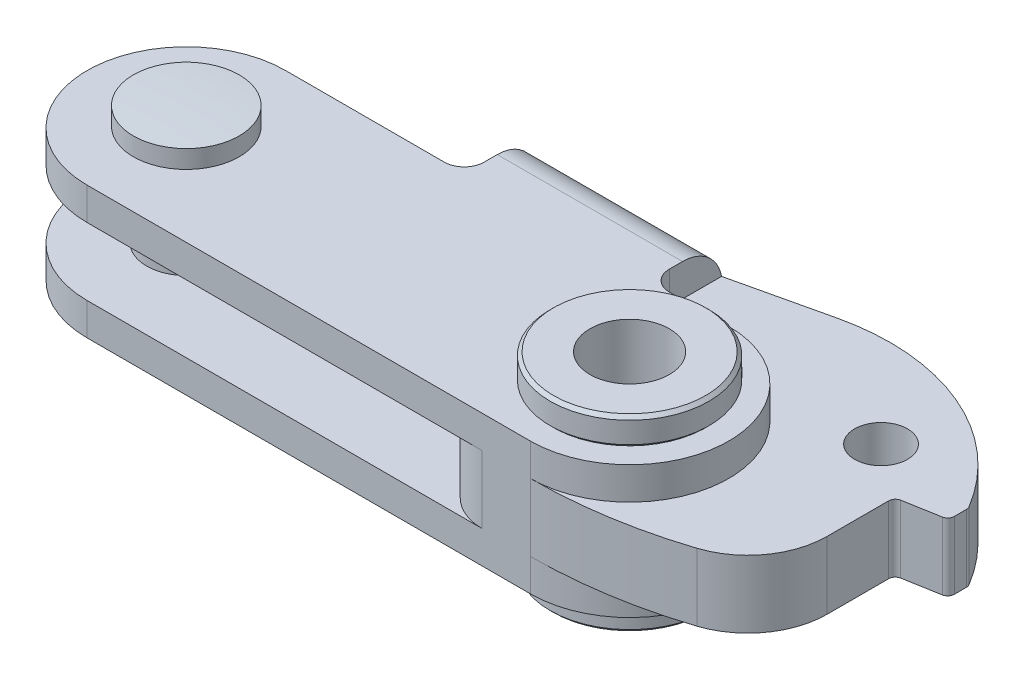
ISO-10303-21;
HEADER;
FILE_DESCRIPTION(('STEP AP214'),'2;1');
FILE_NAME('part.step','',(''),(''),'','','');
FILE_SCHEMA(('AUTOMOTIVE_DESIGN { 1 0 10303 214 1 1 1 1 }'));
ENDSEC;
DATA;
#1=APPLICATION_CONTEXT('core data for automotive mechanical design processes');
#2=APPLICATION_PROTOCOL_DEFINITION('international standard','automotive_design',2000,#1);
#3=PRODUCT_CONTEXT('',#1,'mechanical');
#4=PRODUCT('Part','Part','',(#3));
#5=PRODUCT_RELATED_PRODUCT_CATEGORY('part','',(#4));
#6=PRODUCT_DEFINITION_FORMATION('','',#4);
#7=PRODUCT_DEFINITION_CONTEXT('part definition',#1,'design');
#8=PRODUCT_DEFINITION('design','',#6,#7);
#9=PRODUCT_DEFINITION_SHAPE('','',#8);
#10=(LENGTH_UNIT() NAMED_UNIT(*) SI_UNIT(.MILLI.,.METRE.));
#11=(NAMED_UNIT(*) PLANE_ANGLE_UNIT() SI_UNIT($,.RADIAN.));
#12=(NAMED_UNIT(*) SI_UNIT($,.STERADIAN.) SOLID_ANGLE_UNIT());
#13=UNCERTAINTY_MEASURE_WITH_UNIT(LENGTH_MEASURE(1.E-05),#10,'distance_accuracy_value','');
#14=(GEOMETRIC_REPRESENTATION_CONTEXT(3) GLOBAL_UNCERTAINTY_ASSIGNED_CONTEXT((#13)) GLOBAL_UNIT_ASSIGNED_CONTEXT((#10,
#11,#12)) REPRESENTATION_CONTEXT('',''));
#15=CARTESIAN_POINT('',(0.,0.,0.));
#16=DIRECTION('',(0.,0.,1.));
#17=DIRECTION('',(1.,0.,0.));
#18=AXIS2_PLACEMENT_3D('',#15,#16,#17);
#19=CARTESIAN_POINT('',(27.5,-5.,-9.));
#20=DIRECTION('',(1.,0.,0.));
#21=DIRECTION('',(0.,1.,0.));
#22=AXIS2_PLACEMENT_3D('',#19,#20,#21);
#23=PLANE('',#22);
#24=CARTESIAN_POINT('',(27.5,2.00000000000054,-10.0000000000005));
#25=DIRECTION('',(-1.,0.,0.));
#26=DIRECTION('',(0.,0.,1.));
#27=AXIS2_PLACEMENT_3D('',#24,#25,#26);
#28=CIRCLE('',#27,2.99999999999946);
#29=CARTESIAN_POINT('',(27.5,2.54417696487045,-12.950232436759));
#30=VERTEX_POINT('',#29);
#31=CARTESIAN_POINT('',(27.5,2.,-13.));
#32=VERTEX_POINT('',#31);
#33=EDGE_CURVE('E538',#30,#32,#28,.T.);
#34=ORIENTED_EDGE('',*,*,#33,.F.);
#35=DIRECTION('',(0.,-1.,0.));
#36=VECTOR('',#35,1.);
#37=CARTESIAN_POINT('',(27.5,-5.,-12.950232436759));
#38=LINE('',#37,#36);
#39=CARTESIAN_POINT('',(27.5,-2.54417696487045,-12.950232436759));
#40=VERTEX_POINT('',#39);
#41=EDGE_CURVE('E29',#30,#40,#38,.T.);
#42=ORIENTED_EDGE('',*,*,#41,.T.);
#43=CARTESIAN_POINT('',(27.5,-2.00000000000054,-10.0000000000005));
#44=DIRECTION('',(-1.,0.,0.));
#45=DIRECTION('',(0.,0.,1.));
#46=AXIS2_PLACEMENT_3D('',#43,#44,#45);
#47=CIRCLE('',#46,2.99999999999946);
#48=CARTESIAN_POINT('',(27.5,-2.,-13.));
#49=VERTEX_POINT('',#48);
#50=EDGE_CURVE('E542',#49,#40,#47,.T.);
#51=ORIENTED_EDGE('',*,*,#50,.F.);
#52=DIRECTION('',(0.,1.,0.));
#53=VECTOR('',#52,1.);
#54=CARTESIAN_POINT('',(27.5,-5.,-13.));
#55=LINE('',#54,#53);
#56=EDGE_CURVE('E608',#49,#32,#55,.T.);
#57=ORIENTED_EDGE('',*,*,#56,.T.);
#58=EDGE_LOOP('',(#34,#42,#51,#57));
#59=FACE_BOUND('',#58,.T.);
#60=ADVANCED_FACE('F14',(#59),#23,.T.);
#61=DIRECTION('',(0.,0.,1.));
#62=VECTOR('',#61,1.);
#63=CARTESIAN_POINT('',(27.5,2.55,-12.950232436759));
#64=LINE('',#63,#62);
#65=CARTESIAN_POINT('',(27.5,2.55,-12.9491524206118));
#66=VERTEX_POINT('',#65);
#67=CARTESIAN_POINT('',(27.5,2.55,-9.));
#68=VERTEX_POINT('',#67);
#69=EDGE_CURVE('E37',#66,#68,#64,.T.);
#70=ORIENTED_EDGE('',*,*,#69,.F.);
#71=CARTESIAN_POINT('',(27.5,5.,-10.));
#72=VERTEX_POINT('',#71);
#73=EDGE_CURVE('E539',#72,#66,#28,.T.);
#74=ORIENTED_EDGE('',*,*,#73,.F.);
#75=DIRECTION('',(0.,0.,-1.));
#76=VECTOR('',#75,1.);
#77=CARTESIAN_POINT('',(27.5,5.,-9.));
#78=LINE('',#77,#76);
#79=CARTESIAN_POINT('',(27.5,5.,-9.));
#80=VERTEX_POINT('',#79);
#81=EDGE_CURVE('E579',#80,#72,#78,.T.);
#82=ORIENTED_EDGE('',*,*,#81,.F.);
#83=DIRECTION('',(0.,1.,0.));
#84=VECTOR('',#83,1.);
#85=CARTESIAN_POINT('',(27.5,-5.,-9.));
#86=LINE('',#85,#84);
#87=EDGE_CURVE('E611',#68,#80,#86,.T.);
#88=ORIENTED_EDGE('',*,*,#87,.F.);
#89=EDGE_LOOP('',(#70,#74,#82,#88));
#90=FACE_BOUND('',#89,.T.);
#91=ADVANCED_FACE('F719',(#90),#23,.T.);
#92=CARTESIAN_POINT('',(12.0000000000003,-5.,-8.99999999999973));
#93=DIRECTION('',(0.,1.,0.));
#94=DIRECTION('',(0.,0.,1.));
#95=AXIS2_PLACEMENT_3D('',#92,#93,#94);
#96=CYLINDRICAL_SURFACE('',#95,1.49999999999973);
#97=DIRECTION('',(0.,1.,0.));
#98=VECTOR('',#97,1.);
#99=CARTESIAN_POINT('',(13.5,-5.,-9.));
#100=LINE('',#99,#98);
#101=CARTESIAN_POINT('',(13.5,2.55,-8.99999999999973));
#102=VERTEX_POINT('',#101);
#103=CARTESIAN_POINT('',(13.5,5.,-9.));
#104=VERTEX_POINT('',#103);
#105=EDGE_CURVE('E640',#102,#104,#100,.T.);
#106=ORIENTED_EDGE('',*,*,#105,.F.);
#107=CARTESIAN_POINT('',(12.0000000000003,2.55,-8.99999999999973));
#108=DIRECTION('',(0.,1.,0.));
#109=DIRECTION('',(1.,0.,0.));
#110=AXIS2_PLACEMENT_3D('',#107,#108,#109);
#111=CIRCLE('',#110,1.49999999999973);
#112=CARTESIAN_POINT('',(12.,2.55,-7.5));
#113=VERTEX_POINT('',#112);
#114=EDGE_CURVE('E434',#113,#102,#111,.T.);
#115=ORIENTED_EDGE('',*,*,#114,.F.);
#116=DIRECTION('',(0.,1.,0.));
#117=VECTOR('',#116,1.);
#118=CARTESIAN_POINT('',(12.,-5.,-7.5));
#119=LINE('',#118,#117);
#120=CARTESIAN_POINT('',(12.,5.,-7.5));
#121=VERTEX_POINT('',#120);
#122=EDGE_CURVE('E636',#113,#121,#119,.T.);
#123=ORIENTED_EDGE('',*,*,#122,.T.);
#124=CARTESIAN_POINT('',(12.0000000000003,5.,-8.99999999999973));
#125=DIRECTION('',(0.,-1.,0.));
#126=DIRECTION('',(0.,0.,-1.));
#127=AXIS2_PLACEMENT_3D('',#124,#125,#126);
#128=CIRCLE('',#127,1.49999999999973);
#129=EDGE_CURVE('E558',#104,#121,#128,.T.);
#130=ORIENTED_EDGE('',*,*,#129,.F.);
#131=EDGE_LOOP('',(#106,#115,#123,#130));
#132=FACE_BOUND('',#131,.T.);
#133=ADVANCED_FACE('F727',(#132),#96,.F.);
#134=CARTESIAN_POINT('',(12.,-5.,-7.5));
#135=DIRECTION('',(0.,0.,-1.));
#136=DIRECTION('',(0.,1.,0.));
#137=AXIS2_PLACEMENT_3D('',#134,#135,#136);
#138=PLANE('',#137);
#139=ORIENTED_EDGE('',*,*,#122,.F.);
#140=DIRECTION('',(1.,0.,0.));
#141=VECTOR('',#140,1.);
#142=CARTESIAN_POINT('',(0.,2.55,-7.5));
#143=LINE('',#142,#141);
#144=CARTESIAN_POINT('',(0.,2.55,-7.5));
#145=VERTEX_POINT('',#144);
#146=EDGE_CURVE('E432',#145,#113,#143,.T.);
#147=ORIENTED_EDGE('',*,*,#146,.F.);
#148=DIRECTION('',(0.,1.,0.));
#149=VECTOR('',#148,1.);
#150=CARTESIAN_POINT('',(0.,-5.,-7.5));
#151=LINE('',#150,#149);
#152=CARTESIAN_POINT('',(0.,5.,-7.5));
#153=VERTEX_POINT('',#152);
#154=EDGE_CURVE('E632',#145,#153,#151,.T.);
#155=ORIENTED_EDGE('',*,*,#154,.T.);
#156=DIRECTION('',(-1.,0.,0.));
#157=VECTOR('',#156,1.);
#158=CARTESIAN_POINT('',(12.,5.,-7.5));
#159=LINE('',#158,#157);
#160=EDGE_CURVE('E561',#121,#153,#159,.T.);
#161=ORIENTED_EDGE('',*,*,#160,.F.);
#162=EDGE_LOOP('',(#139,#147,#155,#161));
#163=FACE_BOUND('',#162,.T.);
#164=ADVANCED_FACE('F833',(#163),#138,.T.);
#165=CARTESIAN_POINT('',(0.,-5.,0.));
#166=DIRECTION('',(0.,1.,0.));
#167=DIRECTION('',(0.,0.,1.));
#168=AXIS2_PLACEMENT_3D('',#165,#166,#167);
#169=CYLINDRICAL_SURFACE('',#168,7.5);
#170=ORIENTED_EDGE('',*,*,#154,.F.);
#171=CARTESIAN_POINT('',(0.,2.55,0.));
#172=DIRECTION('',(0.,-1.,0.));
#173=DIRECTION('',(1.,0.,0.));
#174=AXIS2_PLACEMENT_3D('',#171,#172,#173);
#175=CIRCLE('',#174,7.5);
#176=CARTESIAN_POINT('',(0.,2.55,7.5));
#177=VERTEX_POINT('',#176);
#178=EDGE_CURVE('E430',#177,#145,#175,.T.);
#179=ORIENTED_EDGE('',*,*,#178,.F.);
#180=DIRECTION('',(0.,1.,0.));
#181=VECTOR('',#180,1.);
#182=CARTESIAN_POINT('',(0.,-5.,7.5));
#183=LINE('',#182,#181);
#184=CARTESIAN_POINT('',(0.,5.,7.5));
#185=VERTEX_POINT('',#184);
#186=EDGE_CURVE('E627',#177,#185,#183,.T.);
#187=ORIENTED_EDGE('',*,*,#186,.T.);
#188=CARTESIAN_POINT('',(0.,5.,0.));
#189=DIRECTION('',(0.,1.,0.));
#190=DIRECTION('',(0.,0.,-1.));
#191=AXIS2_PLACEMENT_3D('',#188,#189,#190);
#192=CIRCLE('',#191,7.5);
#193=EDGE_CURVE('E564',#153,#185,#192,.T.);
#194=ORIENTED_EDGE('',*,*,#193,.F.);
#195=EDGE_LOOP('',(#170,#179,#187,#194));
#196=FACE_BOUND('',#195,.T.);
#197=ADVANCED_FACE('F838',(#196),#169,.T.);
#198=CARTESIAN_POINT('',(0.,-5.,7.5));
#199=DIRECTION('',(0.,0.,1.));
#200=DIRECTION('',(0.,-1.,0.));
#201=AXIS2_PLACEMENT_3D('',#198,#199,#200);
#202=PLANE('',#201);
#203=DIRECTION('',(-1.,0.,0.));
#204=VECTOR('',#203,1.);
#205=CARTESIAN_POINT('',(29.8568542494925,2.55,7.5));
#206=LINE('',#205,#204);
#207=CARTESIAN_POINT('',(29.8568542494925,2.55,7.5));
#208=VERTEX_POINT('',#207);
#209=EDGE_CURVE('E428',#208,#177,#206,.T.);
#210=ORIENTED_EDGE('',*,*,#209,.F.);
#211=DIRECTION('',(0.,-1.,0.));
#212=VECTOR('',#211,1.);
#213=CARTESIAN_POINT('',(29.8568542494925,0.,7.5));
#214=LINE('',#213,#212);
#215=CARTESIAN_POINT('',(29.8568542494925,-2.55,7.5));
#216=VERTEX_POINT('',#215);
#217=EDGE_CURVE('E681',#208,#216,#214,.T.);
#218=ORIENTED_EDGE('',*,*,#217,.T.);
#219=DIRECTION('',(1.,0.,0.));
#220=VECTOR('',#219,1.);
#221=CARTESIAN_POINT('',(0.,-2.55,7.5));
#222=LINE('',#221,#220);
#223=CARTESIAN_POINT('',(0.,-2.55,7.5));
#224=VERTEX_POINT('',#223);
#225=EDGE_CURVE('E466',#224,#216,#222,.T.);
#226=ORIENTED_EDGE('',*,*,#225,.F.);
#227=CARTESIAN_POINT('',(0.,-5.,7.5));
#228=VERTEX_POINT('',#227);
#229=EDGE_CURVE('E629',#228,#224,#183,.T.);
#230=ORIENTED_EDGE('',*,*,#229,.F.);
#231=DIRECTION('',(1.,0.,0.));
#232=VECTOR('',#231,1.);
#233=CARTESIAN_POINT('',(0.,-5.,7.5));
#234=LINE('',#233,#232);
#235=CARTESIAN_POINT('',(33.5,-5.,7.5));
#236=VERTEX_POINT('',#235);
#237=EDGE_CURVE('E593',#228,#236,#234,.T.);
#238=ORIENTED_EDGE('',*,*,#237,.T.);
#239=DIRECTION('',(0.,1.,0.));
#240=VECTOR('',#239,1.);
#241=CARTESIAN_POINT('',(33.5,-5.,7.5));
#242=LINE('',#241,#240);
#243=CARTESIAN_POINT('',(33.5,-2.55,7.5));
#244=VERTEX_POINT('',#243);
#245=EDGE_CURVE('E624',#236,#244,#242,.T.);
#246=ORIENTED_EDGE('',*,*,#245,.T.);
#247=CARTESIAN_POINT('',(33.5,2.55,7.5));
#248=VERTEX_POINT('',#247);
#249=EDGE_CURVE('E628',#244,#248,#242,.T.);
#250=ORIENTED_EDGE('',*,*,#249,.T.);
#251=CARTESIAN_POINT('',(33.5,5.,7.5));
#252=VERTEX_POINT('',#251);
#253=EDGE_CURVE('E623',#248,#252,#242,.T.);
#254=ORIENTED_EDGE('',*,*,#253,.T.);
#255=DIRECTION('',(1.,0.,0.));
#256=VECTOR('',#255,1.);
#257=CARTESIAN_POINT('',(0.,5.,7.5));
#258=LINE('',#257,#256);
#259=EDGE_CURVE('E567',#185,#252,#258,.T.);
#260=ORIENTED_EDGE('',*,*,#259,.F.);
#261=ORIENTED_EDGE('',*,*,#186,.F.);
#262=EDGE_LOOP('',(#210,#218,#226,#230,#238,#246,#250,#254,#260,#261));
#263=FACE_BOUND('',#262,.T.);
#264=ADVANCED_FACE('F843',(#263),#202,.T.);
#265=ORIENTED_EDGE('',*,*,#229,.T.);
#266=CARTESIAN_POINT('',(0.,-2.55,0.));
#267=DIRECTION('',(0.,1.,0.));
#268=DIRECTION('',(0.,0.,1.));
#269=AXIS2_PLACEMENT_3D('',#266,#267,#268);
#270=CIRCLE('',#269,7.5);
#271=CARTESIAN_POINT('',(0.,-2.55,-7.5));
#272=VERTEX_POINT('',#271);
#273=EDGE_CURVE('E464',#272,#224,#270,.T.);
#274=ORIENTED_EDGE('',*,*,#273,.F.);
#275=CARTESIAN_POINT('',(0.,-5.,-7.5));
#276=VERTEX_POINT('',#275);
#277=EDGE_CURVE('E633',#276,#272,#151,.T.);
#278=ORIENTED_EDGE('',*,*,#277,.F.);
#279=CARTESIAN_POINT('',(0.,-5.,0.));
#280=DIRECTION('',(0.,1.,0.));
#281=DIRECTION('',(0.,0.,-1.));
#282=AXIS2_PLACEMENT_3D('',#279,#280,#281);
#283=CIRCLE('',#282,7.5);
#284=EDGE_CURVE('E590',#276,#228,#283,.T.);
#285=ORIENTED_EDGE('',*,*,#284,.T.);
#286=EDGE_LOOP('',(#265,#274,#278,#285));
#287=FACE_BOUND('',#286,.T.);
#288=ADVANCED_FACE('F856',(#287),#169,.T.);
#289=ORIENTED_EDGE('',*,*,#277,.T.);
#290=DIRECTION('',(-1.,0.,0.));
#291=VECTOR('',#290,1.);
#292=CARTESIAN_POINT('',(12.,-2.55,-7.5));
#293=LINE('',#292,#291);
#294=CARTESIAN_POINT('',(12.,-2.55,-7.5));
#295=VERTEX_POINT('',#294);
#296=EDGE_CURVE('E462',#295,#272,#293,.T.);
#297=ORIENTED_EDGE('',*,*,#296,.F.);
#298=CARTESIAN_POINT('',(12.,-5.,-7.5));
#299=VERTEX_POINT('',#298);
#300=EDGE_CURVE('E637',#299,#295,#119,.T.);
#301=ORIENTED_EDGE('',*,*,#300,.F.);
#302=DIRECTION('',(-1.,0.,0.));
#303=VECTOR('',#302,1.);
#304=CARTESIAN_POINT('',(12.,-5.,-7.5));
#305=LINE('',#304,#303);
#306=EDGE_CURVE('E587',#299,#276,#305,.T.);
#307=ORIENTED_EDGE('',*,*,#306,.T.);
#308=EDGE_LOOP('',(#289,#297,#301,#307));
#309=FACE_BOUND('',#308,.T.);
#310=ADVANCED_FACE('F859',(#309),#138,.T.);
#311=ORIENTED_EDGE('',*,*,#300,.T.);
#312=CARTESIAN_POINT('',(12.0000000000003,-2.55,-8.99999999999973));
#313=DIRECTION('',(0.,-1.,0.));
#314=DIRECTION('',(0.,0.,1.));
#315=AXIS2_PLACEMENT_3D('',#312,#313,#314);
#316=CIRCLE('',#315,1.49999999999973);
#317=CARTESIAN_POINT('',(13.5,-2.55,-9.));
#318=VERTEX_POINT('',#317);
#319=EDGE_CURVE('E460',#318,#295,#316,.T.);
#320=ORIENTED_EDGE('',*,*,#319,.F.);
#321=CARTESIAN_POINT('',(13.5,-5.,-9.));
#322=VERTEX_POINT('',#321);
#323=EDGE_CURVE('E641',#322,#318,#100,.T.);
#324=ORIENTED_EDGE('',*,*,#323,.F.);
#325=CARTESIAN_POINT('',(12.0000000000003,-5.,-8.99999999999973));
#326=DIRECTION('',(0.,-1.,0.));
#327=DIRECTION('',(0.,0.,-1.));
#328=AXIS2_PLACEMENT_3D('',#325,#326,#327);
#329=CIRCLE('',#328,1.49999999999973);
#330=EDGE_CURVE('E584',#322,#299,#329,.T.);
#331=ORIENTED_EDGE('',*,*,#330,.T.);
#332=EDGE_LOOP('',(#311,#320,#324,#331));
#333=FACE_BOUND('',#332,.T.);
#334=ADVANCED_FACE('F861',(#333),#96,.F.);
#335=CARTESIAN_POINT('',(0.,-4.6,0.));
#336=DIRECTION('',(0.,-1.,0.));
#337=DIRECTION('',(0.,0.,1.));
#338=AXIS2_PLACEMENT_3D('',#335,#336,#337);
#339=CONICAL_SURFACE('',#338,2.,1.04719755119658);
#340=CARTESIAN_POINT('',(0.,-3.4452994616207,0.));
#341=VERTEX_POINT('',#340);
#342=VERTEX_LOOP('',#341);
#343=FACE_BOUND('',#342,.T.);
#344=CARTESIAN_POINT('',(0.,-4.6,0.));
#345=DIRECTION('',(0.,1.,0.));
#346=DIRECTION('',(0.,0.,-1.));
#347=AXIS2_PLACEMENT_3D('',#344,#345,#346);
#348=CIRCLE('',#347,2.);
#349=CARTESIAN_POINT('',(0.,-4.6,-2.));
#350=VERTEX_POINT('',#349);
#351=EDGE_CURVE('E478',#350,#350,#348,.T.);
#352=ORIENTED_EDGE('',*,*,#351,.F.);
#353=EDGE_LOOP('',(#352));
#354=FACE_BOUND('',#353,.T.);
#355=ADVANCED_FACE('F1055',(#343,#354),#339,.F.);
#356=CARTESIAN_POINT('',(30.5,-7.1,0.));
#357=DIRECTION('',(0.,1.,0.));
#358=DIRECTION('',(0.,0.,-1.));
#359=AXIS2_PLACEMENT_3D('',#356,#357,#358);
#360=PLANE('',#359);
#361=CARTESIAN_POINT('',(33.5,-7.1,0.));
#362=DIRECTION('',(0.,1.,0.));
#363=DIRECTION('',(0.,0.,1.));
#364=AXIS2_PLACEMENT_3D('',#361,#362,#363);
#365=CIRCLE('',#364,5.75);
#366=CARTESIAN_POINT('',(33.5,-7.1,5.75));
#367=VERTEX_POINT('',#366);
#368=EDGE_CURVE('E22',#367,#367,#365,.F.);
#369=ORIENTED_EDGE('',*,*,#368,.T.);
#370=EDGE_LOOP('',(#369));
#371=FACE_BOUND('',#370,.T.);
#372=CARTESIAN_POINT('',(33.5,-7.1,0.));
#373=DIRECTION('',(0.,1.,0.));
#374=DIRECTION('',(0.,0.,-1.));
#375=AXIS2_PLACEMENT_3D('',#372,#373,#374);
#376=CIRCLE('',#375,3.);
#377=CARTESIAN_POINT('',(33.5,-7.1,-3.));
#378=VERTEX_POINT('',#377);
#379=EDGE_CURVE('E512',#378,#378,#376,.T.);
#380=ORIENTED_EDGE('',*,*,#379,.T.);
#381=EDGE_LOOP('',(#380));
#382=FACE_BOUND('',#381,.T.);
#383=ADVANCED_FACE('F704',(#371,#382),#360,.F.);
#384=CARTESIAN_POINT('',(0.,-3.4452994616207,0.));
#385=DIRECTION('',(0.,1.,0.));
#386=DIRECTION('',(0.,0.,-1.));
#387=AXIS2_PLACEMENT_3D('',#384,#385,#386);
#388=CYLINDRICAL_SURFACE('',#387,2.);
#389=ORIENTED_EDGE('',*,*,#351,.T.);
#390=EDGE_LOOP('',(#389));
#391=FACE_BOUND('',#390,.T.);
#392=CARTESIAN_POINT('',(0.,-6.5666574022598,0.));
#393=DIRECTION('',(0.,1.,0.));
#394=DIRECTION('',(0.,0.,-1.));
#395=AXIS2_PLACEMENT_3D('',#392,#393,#394);
#396=CIRCLE('',#395,2.);
#397=CARTESIAN_POINT('',(-2.00000000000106,-6.5666574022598,0.));
#398=VERTEX_POINT('',#397);
#399=EDGE_CURVE('E481',#398,#398,#396,.T.);
#400=ORIENTED_EDGE('',*,*,#399,.F.);
#401=EDGE_LOOP('',(#400));
#402=FACE_BOUND('',#401,.T.);
#403=ADVANCED_FACE('F981',(#391,#402),#388,.F.);
#404=CARTESIAN_POINT('',(33.5,-7.1,0.));
#405=DIRECTION('',(0.,1.,0.));
#406=DIRECTION('',(0.,0.,-1.));
#407=AXIS2_PLACEMENT_3D('',#404,#405,#406);
#408=CYLINDRICAL_SURFACE('',#407,3.);
#409=ORIENTED_EDGE('',*,*,#379,.F.);
#410=EDGE_LOOP('',(#409));
#411=FACE_BOUND('',#410,.T.);
#412=CARTESIAN_POINT('',(33.5,7.1,0.));
#413=DIRECTION('',(0.,1.,0.));
#414=DIRECTION('',(0.,0.,1.));
#415=AXIS2_PLACEMENT_3D('',#412,#413,#414);
#416=CIRCLE('',#415,3.);
#417=CARTESIAN_POINT('',(33.5,7.1,3.));
#418=VERTEX_POINT('',#417);
#419=EDGE_CURVE('E473',#418,#418,#416,.T.);
#420=ORIENTED_EDGE('',*,*,#419,.T.);
#421=EDGE_LOOP('',(#420));
#422=FACE_BOUND('',#421,.T.);
#423=ADVANCED_FACE('F978',(#411,#422),#408,.F.);
#424=CARTESIAN_POINT('',(7.69527107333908E-12,53.4000000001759,0.));
#425=DIRECTION('',(0.,1.,0.));
#426=DIRECTION('',(-1.,0.,0.));
#427=AXIS2_PLACEMENT_3D('',#424,#425,#426);
#428=SPHERICAL_SURFACE('',#427,60.0000000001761);
#429=CARTESIAN_POINT('',(0.,-6.4665181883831,0.));
#430=DIRECTION('',(0.,1.,0.));
#431=DIRECTION('',(0.,0.,-1.));
#432=AXIS2_PLACEMENT_3D('',#429,#430,#431);
#433=CIRCLE('',#432,4.);
#434=CARTESIAN_POINT('',(-4.00000000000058,-6.4665181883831,0.));
#435=VERTEX_POINT('',#434);
#436=EDGE_CURVE('E485',#435,#435,#433,.T.);
#437=CARTESIAN_POINT('',(-2.00000000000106,-6.5666574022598,0.));
#438=CARTESIAN_POINT('',(-2.02084880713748,-6.56596205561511,0.));
#439=CARTESIAN_POINT('',(-2.04169725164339,-6.56525583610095,0.));
#440=CARTESIAN_POINT('',(-2.083393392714,-6.56382165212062,0.));
#441=CARTESIAN_POINT('',(-2.10424108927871,-6.56309368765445,0.));
#442=CARTESIAN_POINT('',(-2.14593571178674,-6.56161601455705,0.));
#443=CARTESIAN_POINT('',(-2.16678263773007,-6.56086630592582,0.));
#444=CARTESIAN_POINT('',(-2.2084756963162,-6.55934514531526,0.));
#445=CARTESIAN_POINT('',(-2.22932182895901,-6.55857369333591,0.));
#446=CARTESIAN_POINT('',(-2.2710132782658,-6.55700904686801,0.));
#447=CARTESIAN_POINT('',(-2.29185859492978,-6.55621585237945,0.));
#448=CARTESIAN_POINT('',(-2.33354838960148,-6.55460772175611,0.));
#449=CARTESIAN_POINT('',(-2.3543928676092,-6.55379278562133,0.));
#450=CARTESIAN_POINT('',(-2.39608096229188,-6.55214117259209,0.));
#451=CARTESIAN_POINT('',(-2.41692457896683,-6.55130449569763,0.));
#452=CARTESIAN_POINT('',(-2.4586109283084,-6.54960940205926,0.));
#453=CARTESIAN_POINT('',(-2.47945366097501,-6.54875098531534,0.));
#454=CARTESIAN_POINT('',(-2.52113821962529,-6.5470124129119,0.));
#455=CARTESIAN_POINT('',(-2.54198004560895,-6.54613225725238,0.));
#456=CARTESIAN_POINT('',(-2.58366276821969,-6.54435020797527,0.));
#457=CARTESIAN_POINT('',(-2.60450366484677,-6.54344831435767,0.));
#458=CARTESIAN_POINT('',(-2.64618450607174,-6.54162279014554,0.));
#459=CARTESIAN_POINT('',(-2.66702445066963,-6.54069915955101,0.));
#460=CARTESIAN_POINT('',(-2.70870336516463,-6.53883016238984,0.));
#461=CARTESIAN_POINT('',(-2.72954233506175,-6.53788479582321,0.));
#462=CARTESIAN_POINT('',(-2.77121927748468,-6.53597232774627,0.));
#463=CARTESIAN_POINT('',(-2.7920572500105,-6.53500522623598,0.));
#464=CARTESIAN_POINT('',(-2.83373217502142,-6.53304928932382,0.));
#465=CARTESIAN_POINT('',(-2.85456912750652,-6.53206045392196,0.));
#466=CARTESIAN_POINT('',(-2.89624198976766,-6.53006105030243,0.));
#467=CARTESIAN_POINT('',(-2.91707789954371,-6.52905048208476,0.));
#468=CARTESIAN_POINT('',(-2.95874865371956,-6.52700761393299,0.));
#469=CARTESIAN_POINT('',(-2.97958349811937,-6.52597531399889,0.));
#470=CARTESIAN_POINT('',(-3.02125209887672,-6.5238889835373,0.));
#471=CARTESIAN_POINT('',(-3.04208585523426,-6.5228349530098,0.));
#472=CARTESIAN_POINT('',(-3.08375225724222,-6.52070516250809,0.));
#473=CARTESIAN_POINT('',(-3.10458490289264,-6.51962940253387,0.));
#474=CARTESIAN_POINT('',(-3.14624906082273,-6.517456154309,0.));
#475=CARTESIAN_POINT('',(-3.16708057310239,-6.51635866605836,0.));
#476=CARTESIAN_POINT('',(-3.20874244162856,-6.51414196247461,0.));
#477=CARTESIAN_POINT('',(-3.22957279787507,-6.51302274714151,0.));
#478=CARTESIAN_POINT('',(-3.27123233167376,-6.5107625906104,0.));
#479=CARTESIAN_POINT('',(-3.29206150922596,-6.5096216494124,0.));
#480=CARTESIAN_POINT('',(-3.33371866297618,-6.50731804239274,0.));
#481=CARTESIAN_POINT('',(-3.3545466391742,-6.50615537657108,0.));
#482=CARTESIAN_POINT('',(-3.39620136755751,-6.50380832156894,0.));
#483=CARTESIAN_POINT('',(-3.41702811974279,-6.50262393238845,0.));
#484=CARTESIAN_POINT('',(-3.4586803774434,-6.50023343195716,0.));
#485=CARTESIAN_POINT('',(-3.47950588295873,-6.49902732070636,0.));
#486=CARTESIAN_POINT('',(-3.52115562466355,-6.49659337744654,0.));
#487=CARTESIAN_POINT('',(-3.54197986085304,-6.49536554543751,0.));
#488=CARTESIAN_POINT('',(-3.58362704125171,-6.49288816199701,0.));
#489=CARTESIAN_POINT('',(-3.60444998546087,-6.49163861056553,0.));
#490=CARTESIAN_POINT('',(-3.64609455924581,-6.48911778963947,0.));
#491=CARTESIAN_POINT('',(-3.66691618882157,-6.48784652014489,0.));
#492=CARTESIAN_POINT('',(-3.70855811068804,-6.48528226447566,0.));
#493=CARTESIAN_POINT('',(-3.72937840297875,-6.48398927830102,0.));
#494=CARTESIAN_POINT('',(-3.77101762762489,-6.48138159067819,0.));
#495=CARTESIAN_POINT('',(-3.79183655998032,-6.48006688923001,0.));
#496=CARTESIAN_POINT('',(-3.83347304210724,-6.47741577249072,0.));
#497=CARTESIAN_POINT('',(-3.85429059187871,-6.47607935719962,0.));
#498=CARTESIAN_POINT('',(-3.8959242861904,-6.47338481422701,0.));
#499=CARTESIAN_POINT('',(-3.9167404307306,-6.47202668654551,0.));
#500=CARTESIAN_POINT('',(-3.9583712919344,-6.4692887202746,0.));
#501=CARTESIAN_POINT('',(-3.97918600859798,-6.4679088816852,0.));
#502=CARTESIAN_POINT('',(-4.00000000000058,-6.4665181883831,0.));
#503=B_SPLINE_CURVE_WITH_KNOTS('',3,(#437,#438,#439,#440,#441,#442,#443,#444,#445,#446,#447,
#448,#449,#450,#451,#452,#453,#454,#455,#456,#457,#458,#459,#460,#461,#462,#463,#464,#465,#466,
#467,#468,#469,#470,#471,#472,#473,#474,#475,#476,#477,#478,#479,#480,#481,#482,#483,#484,#485,
#486,#487,#488,#489,#490,#491,#492,#493,#494,#495,#496,#497,#498,#499,#500,#501,#502),
.UNSPECIFIED.,.F.,.F.,(4,2,2,2,2,2,2,2,2,2,2,2,2,2,2,2,2,2,2,2,2,2,2,2,2,2,2,2,2,2,2,2,4),(0.,
0.0625811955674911,0.12516239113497,0.187743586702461,0.250324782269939,0.31290597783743,
0.375487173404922,0.4380683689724,0.500649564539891,0.563230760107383,0.625811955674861,
0.688393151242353,0.750974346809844,0.813555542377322,0.876136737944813,0.938717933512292,
1.00129912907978,1.06388032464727,1.12646152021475,1.18904271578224,1.25162391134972,
1.31420510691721,1.37678630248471,1.43936749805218,1.50194869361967,1.56452988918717,
1.62711108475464,1.68969228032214,1.75227347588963,1.81485467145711,1.8774358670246,
1.94001706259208,2.00259825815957),.UNSPECIFIED.);
#504=EDGE_CURVE('BSEAM980',#398,#435,#503,.T.);
#505=ORIENTED_EDGE('',*,*,#399,.T.);
#506=ORIENTED_EDGE('',*,*,#436,.F.);
#507=ORIENTED_EDGE('',*,*,#504,.T.);
#508=ORIENTED_EDGE('',*,*,#504,.F.);
#509=EDGE_LOOP('',(#505,#507,#506,#508));
#510=FACE_BOUND('',#509,.T.);
#511=ADVANCED_FACE('F980',(#510),#428,.T.);
#512=CARTESIAN_POINT('',(1.17618025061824E-12,-53.4000000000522,0.));
#513=DIRECTION('',(0.,1.,0.));
#514=DIRECTION('',(-1.,0.,0.));
#515=AXIS2_PLACEMENT_3D('',#512,#513,#514);
#516=SPHERICAL_SURFACE('',#515,60.0000000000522);
#517=CARTESIAN_POINT('',(0.,6.46651818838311,0.));
#518=DIRECTION('',(0.,1.,0.));
#519=DIRECTION('',(0.,0.,-1.));
#520=AXIS2_PLACEMENT_3D('',#517,#518,#519);
#521=CIRCLE('',#520,4.);
#522=CARTESIAN_POINT('',(0.,6.46651818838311,-4.));
#523=VERTEX_POINT('',#522);
#524=EDGE_CURVE('E500',#523,#523,#521,.T.);
#525=ORIENTED_EDGE('',*,*,#524,.T.);
#526=EDGE_LOOP('',(#525));
#527=FACE_BOUND('',#526,.T.);
#528=ADVANCED_FACE('F989',(#527),#516,.T.);
#529=CARTESIAN_POINT('',(0.,-3.4452994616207,0.));
#530=DIRECTION('',(0.,1.,0.));
#531=DIRECTION('',(0.,0.,-1.));
#532=AXIS2_PLACEMENT_3D('',#529,#530,#531);
#533=CYLINDRICAL_SURFACE('',#532,4.);
#534=ORIENTED_EDGE('',*,*,#436,.T.);
#535=EDGE_LOOP('',(#534));
#536=FACE_BOUND('',#535,.T.);
#537=CARTESIAN_POINT('',(0.,-5.1,0.));
#538=DIRECTION('',(0.,1.,0.));
#539=DIRECTION('',(0.,0.,-1.));
#540=AXIS2_PLACEMENT_3D('',#537,#538,#539);
#541=CIRCLE('',#540,4.);
#542=CARTESIAN_POINT('',(0.,-5.1,-4.));
#543=VERTEX_POINT('',#542);
#544=EDGE_CURVE('E488',#543,#543,#541,.T.);
#545=ORIENTED_EDGE('',*,*,#544,.F.);
#546=EDGE_LOOP('',(#545));
#547=FACE_BOUND('',#546,.T.);
#548=ADVANCED_FACE('F1010',(#536,#547),#533,.T.);
#549=CARTESIAN_POINT('',(0.,-3.4452994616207,0.));
#550=DIRECTION('',(0.,1.,0.));
#551=DIRECTION('',(0.,0.,-1.));
#552=AXIS2_PLACEMENT_3D('',#549,#550,#551);
#553=CYLINDRICAL_SURFACE('',#552,4.);
#554=CARTESIAN_POINT('',(0.,5.1,0.));
#555=DIRECTION('',(0.,1.,0.));
#556=DIRECTION('',(0.,0.,-1.));
#557=AXIS2_PLACEMENT_3D('',#554,#555,#556);
#558=CIRCLE('',#557,4.);
#559=CARTESIAN_POINT('',(0.,5.1,-4.));
#560=VERTEX_POINT('',#559);
#561=EDGE_CURVE('E497',#560,#560,#558,.T.);
#562=ORIENTED_EDGE('',*,*,#561,.T.);
#563=EDGE_LOOP('',(#562));
#564=FACE_BOUND('',#563,.T.);
#565=ORIENTED_EDGE('',*,*,#524,.F.);
#566=EDGE_LOOP('',(#565));
#567=FACE_BOUND('',#566,.T.);
#568=ADVANCED_FACE('F1000',(#564,#567),#553,.T.);
#569=CARTESIAN_POINT('',(33.5,-5.,0.));
#570=DIRECTION('',(0.,-1.,0.));
#571=DIRECTION('',(0.,0.,1.));
#572=AXIS2_PLACEMENT_3D('',#569,#570,#571);
#573=CYLINDRICAL_SURFACE('',#572,6.);
#574=CARTESIAN_POINT('',(33.5,-6.85,0.));
#575=DIRECTION('',(0.,1.,0.));
#576=DIRECTION('',(0.,0.,1.));
#577=AXIS2_PLACEMENT_3D('',#574,#575,#576);
#578=CIRCLE('',#577,6.);
#579=CARTESIAN_POINT('',(33.5,-6.85,6.));
#580=VERTEX_POINT('',#579);
#581=EDGE_CURVE('E9',#580,#580,#578,.T.);
#582=ORIENTED_EDGE('',*,*,#581,.T.);
#583=EDGE_LOOP('',(#582));
#584=FACE_BOUND('',#583,.T.);
#585=CARTESIAN_POINT('',(33.5,-5.2,0.));
#586=DIRECTION('',(0.,-1.,0.));
#587=DIRECTION('',(0.,0.,1.));
#588=AXIS2_PLACEMENT_3D('',#585,#586,#587);
#589=CIRCLE('',#588,6.);
#590=CARTESIAN_POINT('',(33.5,-5.2,6.));
#591=VERTEX_POINT('',#590);
#592=EDGE_CURVE('E655',#591,#591,#589,.T.);
#593=ORIENTED_EDGE('',*,*,#592,.T.);
#594=EDGE_LOOP('',(#593));
#595=FACE_BOUND('',#594,.T.);
#596=ADVANCED_FACE('F997',(#584,#595),#573,.T.);
#597=CARTESIAN_POINT('',(-3.,-5.1,0.));
#598=DIRECTION('',(0.,1.,0.));
#599=DIRECTION('',(0.,0.,-1.));
#600=AXIS2_PLACEMENT_3D('',#597,#598,#599);
#601=PLANE('',#600);
#602=ORIENTED_EDGE('',*,*,#544,.T.);
#603=EDGE_LOOP('',(#602));
#604=FACE_BOUND('',#603,.T.);
#605=CARTESIAN_POINT('',(0.,-5.1,0.));
#606=DIRECTION('',(0.,1.,0.));
#607=DIRECTION('',(0.,0.,-1.));
#608=AXIS2_PLACEMENT_3D('',#605,#606,#607);
#609=CIRCLE('',#608,3.);
#610=CARTESIAN_POINT('',(0.,-5.1,-3.));
#611=VERTEX_POINT('',#610);
#612=EDGE_CURVE('E491',#611,#611,#609,.T.);
#613=ORIENTED_EDGE('',*,*,#612,.F.);
#614=EDGE_LOOP('',(#613));
#615=FACE_BOUND('',#614,.T.);
#616=ADVANCED_FACE('F999',(#604,#615),#601,.T.);
#617=CARTESIAN_POINT('',(33.5,-7.1,0.));
#618=DIRECTION('',(0.,1.,0.));
#619=DIRECTION('',(0.,0.,-1.));
#620=AXIS2_PLACEMENT_3D('',#617,#618,#619);
#621=CYLINDRICAL_SURFACE('',#620,6.);
#622=CARTESIAN_POINT('',(33.5,6.85,0.));
#623=DIRECTION('',(0.,1.,0.));
#624=DIRECTION('',(0.,0.,1.));
#625=AXIS2_PLACEMENT_3D('',#622,#623,#624);
#626=CIRCLE('',#625,6.);
#627=CARTESIAN_POINT('',(33.5,6.85,6.));
#628=VERTEX_POINT('',#627);
#629=EDGE_CURVE('E699',#628,#628,#626,.F.);
#630=ORIENTED_EDGE('',*,*,#629,.T.);
#631=EDGE_LOOP('',(#630));
#632=FACE_BOUND('',#631,.T.);
#633=CARTESIAN_POINT('',(33.5,5.25,0.));
#634=DIRECTION('',(0.,1.,0.));
#635=DIRECTION('',(0.,0.,-1.));
#636=AXIS2_PLACEMENT_3D('',#633,#634,#635);
#637=CIRCLE('',#636,6.);
#638=CARTESIAN_POINT('',(33.5,5.25,-6.));
#639=VERTEX_POINT('',#638);
#640=EDGE_CURVE('E652',#639,#639,#637,.T.);
#641=ORIENTED_EDGE('',*,*,#640,.T.);
#642=EDGE_LOOP('',(#641));
#643=FACE_BOUND('',#642,.T.);
#644=ADVANCED_FACE('F1007',(#632,#643),#621,.T.);
#645=CARTESIAN_POINT('',(-4.,5.1,0.));
#646=DIRECTION('',(0.,-1.,0.));
#647=DIRECTION('',(0.,0.,1.));
#648=AXIS2_PLACEMENT_3D('',#645,#646,#647);
#649=PLANE('',#648);
#650=CARTESIAN_POINT('',(0.,5.1,0.));
#651=DIRECTION('',(0.,1.,0.));
#652=DIRECTION('',(0.,0.,-1.));
#653=AXIS2_PLACEMENT_3D('',#650,#651,#652);
#654=CIRCLE('',#653,3.);
#655=CARTESIAN_POINT('',(0.,5.1,-3.));
#656=VERTEX_POINT('',#655);
#657=EDGE_CURVE('E494',#656,#656,#654,.T.);
#658=ORIENTED_EDGE('',*,*,#657,.T.);
#659=EDGE_LOOP('',(#658));
#660=FACE_BOUND('',#659,.T.);
#661=ORIENTED_EDGE('',*,*,#561,.F.);
#662=EDGE_LOOP('',(#661));
#663=FACE_BOUND('',#662,.T.);
#664=ADVANCED_FACE('F1019',(#660,#663),#649,.T.);
#665=CARTESIAN_POINT('',(33.5,-5.,0.));
#666=DIRECTION('',(0.,-1.,0.));
#667=DIRECTION('',(0.,0.,1.));
#668=AXIS2_PLACEMENT_3D('',#665,#666,#667);
#669=CONICAL_SURFACE('',#668,5.8,0.785398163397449);
#670=ORIENTED_EDGE('',*,*,#592,.F.);
#671=EDGE_LOOP('',(#670));
#672=FACE_BOUND('',#671,.T.);
#673=CARTESIAN_POINT('',(33.5,-5.,0.));
#674=DIRECTION('',(0.,-1.,0.));
#675=DIRECTION('',(0.,0.,-1.));
#676=AXIS2_PLACEMENT_3D('',#673,#674,#675);
#677=CIRCLE('',#676,5.8);
#678=CARTESIAN_POINT('',(33.5,-5.,-5.8));
#679=VERTEX_POINT('',#678);
#680=EDGE_CURVE('E647',#679,#679,#677,.F.);
#681=ORIENTED_EDGE('',*,*,#680,.F.);
#682=EDGE_LOOP('',(#681));
#683=FACE_BOUND('',#682,.T.);
#684=ADVANCED_FACE('F929',(#672,#683),#669,.T.);
#685=CARTESIAN_POINT('',(0.,-3.4452994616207,0.));
#686=DIRECTION('',(0.,1.,0.));
#687=DIRECTION('',(0.,0.,-1.));
#688=AXIS2_PLACEMENT_3D('',#685,#686,#687);
#689=CYLINDRICAL_SURFACE('',#688,3.);
#690=CARTESIAN_POINT('',(0.,-5.,0.));
#691=DIRECTION('',(0.,-1.,0.));
#692=DIRECTION('',(0.,0.,-1.));
#693=AXIS2_PLACEMENT_3D('',#690,#691,#692);
#694=CIRCLE('',#693,3.);
#695=CARTESIAN_POINT('',(0.,-5.,-3.));
#696=VERTEX_POINT('',#695);
#697=EDGE_CURVE('E506',#696,#696,#694,.F.);
#698=ORIENTED_EDGE('',*,*,#697,.F.);
#699=EDGE_LOOP('',(#698));
#700=FACE_BOUND('',#699,.T.);
#701=ORIENTED_EDGE('',*,*,#612,.T.);
#702=EDGE_LOOP('',(#701));
#703=FACE_BOUND('',#702,.T.);
#704=ADVANCED_FACE('F1018',(#700,#703),#689,.T.);
#705=CARTESIAN_POINT('',(33.5,5.,0.));
#706=DIRECTION('',(0.,1.,0.));
#707=DIRECTION('',(0.,0.,-1.));
#708=AXIS2_PLACEMENT_3D('',#705,#706,#707);
#709=CONICAL_SURFACE('',#708,5.75,0.785398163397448);
#710=ORIENTED_EDGE('',*,*,#640,.F.);
#711=EDGE_LOOP('',(#710));
#712=FACE_BOUND('',#711,.T.);
#713=CARTESIAN_POINT('',(33.5,5.,0.));
#714=DIRECTION('',(0.,-1.,0.));
#715=DIRECTION('',(0.,0.,-1.));
#716=AXIS2_PLACEMENT_3D('',#713,#714,#715);
#717=CIRCLE('',#716,5.75);
#718=CARTESIAN_POINT('',(33.5,5.,-5.75));
#719=VERTEX_POINT('',#718);
#720=EDGE_CURVE('E482',#719,#719,#717,.F.);
#721=ORIENTED_EDGE('',*,*,#720,.T.);
#722=EDGE_LOOP('',(#721));
#723=FACE_BOUND('',#722,.T.);
#724=ADVANCED_FACE('F1048',(#712,#723),#709,.T.);
#725=ORIENTED_EDGE('',*,*,#657,.F.);
#726=EDGE_LOOP('',(#725));
#727=FACE_BOUND('',#726,.T.);
#728=CARTESIAN_POINT('',(0.,5.,0.));
#729=DIRECTION('',(0.,-1.,0.));
#730=DIRECTION('',(0.,0.,-1.));
#731=AXIS2_PLACEMENT_3D('',#728,#729,#730);
#732=CIRCLE('',#731,3.);
#733=CARTESIAN_POINT('',(0.,5.,-3.));
#734=VERTEX_POINT('',#733);
#735=EDGE_CURVE('E503',#734,#734,#732,.F.);
#736=ORIENTED_EDGE('',*,*,#735,.T.);
#737=EDGE_LOOP('',(#736));
#738=FACE_BOUND('',#737,.T.);
#739=ADVANCED_FACE('F1050',(#727,#738),#689,.T.);
#740=CARTESIAN_POINT('',(33.5,-5.,0.));
#741=DIRECTION('',(0.,1.,0.));
#742=DIRECTION('',(0.,0.,1.));
#743=AXIS2_PLACEMENT_3D('',#740,#741,#742);
#744=CYLINDRICAL_SURFACE('',#743,7.5);
#745=CARTESIAN_POINT('',(33.5,-2.55,0.));
#746=DIRECTION('',(0.,1.,0.));
#747=DIRECTION('',(0.,0.,-1.));
#748=AXIS2_PLACEMENT_3D('',#745,#746,#747);
#749=CIRCLE('',#748,7.5);
#750=CARTESIAN_POINT('',(33.5,-2.55,-7.5));
#751=VERTEX_POINT('',#750);
#752=EDGE_CURVE('E398',#244,#751,#749,.T.);
#753=ORIENTED_EDGE('',*,*,#752,.F.);
#754=ORIENTED_EDGE('',*,*,#245,.F.);
#755=CARTESIAN_POINT('',(33.5,-5.,0.));
#756=DIRECTION('',(0.,1.,0.));
#757=DIRECTION('',(0.,0.,1.));
#758=AXIS2_PLACEMENT_3D('',#755,#756,#757);
#759=CIRCLE('',#758,7.5);
#760=CARTESIAN_POINT('',(33.5,-5.,-7.5));
#761=VERTEX_POINT('',#760);
#762=EDGE_CURVE('E596',#236,#761,#759,.T.);
#763=ORIENTED_EDGE('',*,*,#762,.T.);
#764=DIRECTION('',(0.,1.,0.));
#765=VECTOR('',#764,1.);
#766=CARTESIAN_POINT('',(33.5,-5.,-7.5));
#767=LINE('',#766,#765);
#768=EDGE_CURVE('E620',#761,#751,#767,.T.);
#769=ORIENTED_EDGE('',*,*,#768,.T.);
#770=EDGE_LOOP('',(#753,#754,#763,#769));
#771=FACE_BOUND('',#770,.T.);
#772=ADVANCED_FACE('F745',(#771),#744,.T.);
#773=CARTESIAN_POINT('',(27.5,2.00000000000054,-10.0000000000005));
#774=DIRECTION('',(-1.,0.,0.));
#775=DIRECTION('',(0.,-1.,0.));
#776=AXIS2_PLACEMENT_3D('',#773,#774,#775);
#777=CYLINDRICAL_SURFACE('',#776,2.99999999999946);
#778=CARTESIAN_POINT('',(13.5,2.00000000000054,-10.0000000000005));
#779=DIRECTION('',(-1.,0.,0.));
#780=DIRECTION('',(0.,0.,1.));
#781=AXIS2_PLACEMENT_3D('',#778,#779,#780);
#782=CIRCLE('',#781,2.99999999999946);
#783=CARTESIAN_POINT('',(13.5,5.,-10.0000000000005));
#784=VERTEX_POINT('',#783);
#785=CARTESIAN_POINT('',(13.5,2.,-13.));
#786=VERTEX_POINT('',#785);
#787=EDGE_CURVE('E530',#784,#786,#782,.T.);
#788=ORIENTED_EDGE('',*,*,#787,.F.);
#789=DIRECTION('',(-1.,0.,0.));
#790=VECTOR('',#789,1.);
#791=CARTESIAN_POINT('',(27.5,5.,-10.));
#792=LINE('',#791,#790);
#793=EDGE_CURVE('E552',#72,#784,#792,.T.);
#794=ORIENTED_EDGE('',*,*,#793,.F.);
#795=ORIENTED_EDGE('',*,*,#73,.T.);
#796=CARTESIAN_POINT('',(27.5,2.00000000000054,-10.0000000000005));
#797=DIRECTION('',(1.,0.,0.));
#798=DIRECTION('',(0.,1.,0.));
#799=AXIS2_PLACEMENT_3D('',#796,#797,#798);
#800=CIRCLE('',#799,2.99999999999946);
#801=EDGE_CURVE('E359',#66,#30,#800,.F.);
#802=ORIENTED_EDGE('',*,*,#801,.T.);
#803=ORIENTED_EDGE('',*,*,#33,.T.);
#804=DIRECTION('',(-1.,0.,0.));
#805=VECTOR('',#804,1.);
#806=CARTESIAN_POINT('',(27.5,2.,-13.));
#807=LINE('',#806,#805);
#808=EDGE_CURVE('E550',#32,#786,#807,.T.);
#809=ORIENTED_EDGE('',*,*,#808,.T.);
#810=EDGE_LOOP('',(#788,#794,#795,#802,#803,#809));
#811=FACE_BOUND('',#810,.T.);
#812=ADVANCED_FACE('F823',(#811),#777,.T.);
#813=CARTESIAN_POINT('',(27.5,-5.,-13.));
#814=DIRECTION('',(0.,0.,-1.));
#815=DIRECTION('',(0.,1.,0.));
#816=AXIS2_PLACEMENT_3D('',#813,#814,#815);
#817=PLANE('',#816);
#818=ORIENTED_EDGE('',*,*,#808,.F.);
#819=ORIENTED_EDGE('',*,*,#56,.F.);
#820=DIRECTION('',(-1.,0.,0.));
#821=VECTOR('',#820,1.);
#822=CARTESIAN_POINT('',(27.5,-2.,-13.));
#823=LINE('',#822,#821);
#824=CARTESIAN_POINT('',(13.5,-2.,-13.));
#825=VERTEX_POINT('',#824);
#826=EDGE_CURVE('E547',#49,#825,#823,.T.);
#827=ORIENTED_EDGE('',*,*,#826,.T.);
#828=DIRECTION('',(0.,1.,0.));
#829=VECTOR('',#828,1.);
#830=CARTESIAN_POINT('',(13.5,-5.,-13.));
#831=LINE('',#830,#829);
#832=EDGE_CURVE('E644',#825,#786,#831,.T.);
#833=ORIENTED_EDGE('',*,*,#832,.T.);
#834=EDGE_LOOP('',(#818,#819,#827,#833));
#835=FACE_BOUND('',#834,.T.);
#836=ADVANCED_FACE('F770',(#835),#817,.T.);
#837=CARTESIAN_POINT('',(27.5,-2.00000000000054,-10.0000000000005));
#838=DIRECTION('',(-1.,0.,0.));
#839=DIRECTION('',(0.,-1.,0.));
#840=AXIS2_PLACEMENT_3D('',#837,#838,#839);
#841=CYLINDRICAL_SURFACE('',#840,2.99999999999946);
#842=CARTESIAN_POINT('',(13.5,-2.00000000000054,-10.0000000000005));
#843=DIRECTION('',(-1.,0.,0.));
#844=DIRECTION('',(0.,0.,1.));
#845=AXIS2_PLACEMENT_3D('',#842,#843,#844);
#846=CIRCLE('',#845,2.99999999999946);
#847=CARTESIAN_POINT('',(13.5,-5.,-10.));
#848=VERTEX_POINT('',#847);
#849=EDGE_CURVE('E534',#825,#848,#846,.T.);
#850=ORIENTED_EDGE('',*,*,#849,.F.);
#851=ORIENTED_EDGE('',*,*,#826,.F.);
#852=ORIENTED_EDGE('',*,*,#50,.T.);
#853=CARTESIAN_POINT('',(27.5,-2.00000000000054,-10.0000000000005));
#854=DIRECTION('',(1.,0.,0.));
#855=DIRECTION('',(0.,1.,0.));
#856=AXIS2_PLACEMENT_3D('',#853,#854,#855);
#857=CIRCLE('',#856,2.99999999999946);
#858=CARTESIAN_POINT('',(27.5,-2.55,-12.9491524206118));
#859=VERTEX_POINT('',#858);
#860=EDGE_CURVE('E404',#40,#859,#857,.F.);
#861=ORIENTED_EDGE('',*,*,#860,.T.);
#862=CARTESIAN_POINT('',(27.5,-5.,-10.0000000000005));
#863=VERTEX_POINT('',#862);
#864=EDGE_CURVE('E541',#859,#863,#47,.T.);
#865=ORIENTED_EDGE('',*,*,#864,.T.);
#866=DIRECTION('',(-1.,0.,0.));
#867=VECTOR('',#866,1.);
#868=CARTESIAN_POINT('',(27.5,-5.,-10.));
#869=LINE('',#868,#867);
#870=EDGE_CURVE('E545',#863,#848,#869,.T.);
#871=ORIENTED_EDGE('',*,*,#870,.T.);
#872=EDGE_LOOP('',(#850,#851,#852,#861,#865,#871));
#873=FACE_BOUND('',#872,.T.);
#874=ADVANCED_FACE('F761',(#873),#841,.T.);
#875=CARTESIAN_POINT('',(12.0000000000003,-5.,-8.99999999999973));
#876=DIRECTION('',(0.,-1.,0.));
#877=DIRECTION('',(0.,0.,-1.));
#878=AXIS2_PLACEMENT_3D('',#875,#876,#877);
#879=PLANE('',#878);
#880=ORIENTED_EDGE('',*,*,#870,.F.);
#881=DIRECTION('',(0.,0.,-1.));
#882=VECTOR('',#881,1.);
#883=CARTESIAN_POINT('',(27.5,-5.,-9.));
#884=LINE('',#883,#882);
#885=CARTESIAN_POINT('',(27.5,-5.,-9.));
#886=VERTEX_POINT('',#885);
#887=EDGE_CURVE('E605',#886,#863,#884,.T.);
#888=ORIENTED_EDGE('',*,*,#887,.F.);
#889=CARTESIAN_POINT('',(29.,-5.,-8.99999999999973));
#890=DIRECTION('',(0.,-1.,0.));
#891=DIRECTION('',(0.,0.,1.));
#892=AXIS2_PLACEMENT_3D('',#889,#890,#891);
#893=CIRCLE('',#892,1.49999999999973);
#894=CARTESIAN_POINT('',(29.,-5.,-7.5));
#895=VERTEX_POINT('',#894);
#896=EDGE_CURVE('E602',#895,#886,#893,.T.);
#897=ORIENTED_EDGE('',*,*,#896,.F.);
#898=DIRECTION('',(-1.,0.,0.));
#899=VECTOR('',#898,1.);
#900=CARTESIAN_POINT('',(33.5,-5.,-7.5));
#901=LINE('',#900,#899);
#902=EDGE_CURVE('E599',#761,#895,#901,.T.);
#903=ORIENTED_EDGE('',*,*,#902,.F.);
#904=ORIENTED_EDGE('',*,*,#762,.F.);
#905=ORIENTED_EDGE('',*,*,#237,.F.);
#906=ORIENTED_EDGE('',*,*,#284,.F.);
#907=ORIENTED_EDGE('',*,*,#306,.F.);
#908=ORIENTED_EDGE('',*,*,#330,.F.);
#909=DIRECTION('',(0.,0.,1.));
#910=VECTOR('',#909,1.);
#911=CARTESIAN_POINT('',(13.5,-5.,-13.));
#912=LINE('',#911,#910);
#913=EDGE_CURVE('E582',#848,#322,#912,.T.);
#914=ORIENTED_EDGE('',*,*,#913,.F.);
#915=EDGE_LOOP('',(#880,#888,#897,#903,#904,#905,#906,#907,#908,#914));
#916=FACE_BOUND('',#915,.T.);
#917=ORIENTED_EDGE('',*,*,#697,.T.);
#918=EDGE_LOOP('',(#917));
#919=FACE_BOUND('',#918,.T.);
#920=ORIENTED_EDGE('',*,*,#680,.T.);
#921=EDGE_LOOP('',(#920));
#922=FACE_BOUND('',#921,.T.);
#923=ADVANCED_FACE('F756',(#916,#919,#922),#879,.T.);
#924=CARTESIAN_POINT('',(29.,-5.,-8.99999999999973));
#925=DIRECTION('',(0.,1.,0.));
#926=DIRECTION('',(0.,0.,1.));
#927=AXIS2_PLACEMENT_3D('',#924,#925,#926);
#928=CYLINDRICAL_SURFACE('',#927,1.49999999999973);
#929=CARTESIAN_POINT('',(29.,-2.55,-8.99999999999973));
#930=DIRECTION('',(0.,-1.,0.));
#931=DIRECTION('',(0.,0.,-1.));
#932=AXIS2_PLACEMENT_3D('',#929,#930,#931);
#933=CIRCLE('',#932,1.49999999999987);
#934=CARTESIAN_POINT('',(29.,-2.55,-7.5));
#935=VERTEX_POINT('',#934);
#936=CARTESIAN_POINT('',(27.5,-2.55,-8.99999999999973));
#937=VERTEX_POINT('',#936);
#938=EDGE_CURVE('E365',#935,#937,#933,.T.);
#939=ORIENTED_EDGE('',*,*,#938,.F.);
#940=DIRECTION('',(0.,1.,0.));
#941=VECTOR('',#940,1.);
#942=CARTESIAN_POINT('',(29.,-5.,-7.5));
#943=LINE('',#942,#941);
#944=EDGE_CURVE('E616',#895,#935,#943,.T.);
#945=ORIENTED_EDGE('',*,*,#944,.F.);
#946=ORIENTED_EDGE('',*,*,#896,.T.);
#947=EDGE_CURVE('E612',#886,#937,#86,.T.);
#948=ORIENTED_EDGE('',*,*,#947,.T.);
#949=EDGE_LOOP('',(#939,#945,#946,#948));
#950=FACE_BOUND('',#949,.T.);
#951=ADVANCED_FACE('F741',(#950),#928,.F.);
#952=CARTESIAN_POINT('',(33.5,-5.,-7.5));
#953=DIRECTION('',(0.,0.,-1.));
#954=DIRECTION('',(0.,1.,0.));
#955=AXIS2_PLACEMENT_3D('',#952,#953,#954);
#956=PLANE('',#955);
#957=DIRECTION('',(1.,0.,0.));
#958=VECTOR('',#957,1.);
#959=CARTESIAN_POINT('',(29.,2.55,-7.49999999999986));
#960=LINE('',#959,#958);
#961=CARTESIAN_POINT('',(29.,2.55,-7.5));
#962=VERTEX_POINT('',#961);
#963=CARTESIAN_POINT('',(33.5,2.55,-7.5));
#964=VERTEX_POINT('',#963);
#965=EDGE_CURVE('E331',#962,#964,#960,.T.);
#966=ORIENTED_EDGE('',*,*,#965,.F.);
#967=CARTESIAN_POINT('',(29.,5.,-7.5));
#968=VERTEX_POINT('',#967);
#969=EDGE_CURVE('E615',#962,#968,#943,.T.);
#970=ORIENTED_EDGE('',*,*,#969,.T.);
#971=DIRECTION('',(-1.,0.,0.));
#972=VECTOR('',#971,1.);
#973=CARTESIAN_POINT('',(33.5,5.,-7.5));
#974=LINE('',#973,#972);
#975=CARTESIAN_POINT('',(33.5,5.,-7.5));
#976=VERTEX_POINT('',#975);
#977=EDGE_CURVE('E573',#976,#968,#974,.T.);
#978=ORIENTED_EDGE('',*,*,#977,.F.);
#979=EDGE_CURVE('E619',#964,#976,#767,.T.);
#980=ORIENTED_EDGE('',*,*,#979,.F.);
#981=EDGE_LOOP('',(#966,#970,#978,#980));
#982=FACE_BOUND('',#981,.T.);
#983=ADVANCED_FACE('F815',(#982),#956,.T.);
#984=CARTESIAN_POINT('',(28.5,-2.,-10.5));
#985=DIRECTION('',(0.,0.,1.));
#986=DIRECTION('',(0.,-1.,0.));
#987=AXIS2_PLACEMENT_3D('',#984,#985,#986);
#988=PLANE('',#987);
#989=DIRECTION('',(0.,-1.,0.));
#990=VECTOR('',#989,1.);
#991=CARTESIAN_POINT('',(27.49,-2.,-10.5));
#992=LINE('',#991,#990);
#993=CARTESIAN_POINT('',(27.49,2.,-10.5));
#994=VERTEX_POINT('',#993);
#995=CARTESIAN_POINT('',(27.49,-2.,-10.5));
#996=VERTEX_POINT('',#995);
#997=EDGE_CURVE('E692',#994,#996,#992,.T.);
#998=ORIENTED_EDGE('',*,*,#997,.F.);
#999=DIRECTION('',(-1.,0.,0.));
#1000=VECTOR('',#999,1.);
#1001=CARTESIAN_POINT('',(28.5,2.,-10.5));
#1002=LINE('',#1001,#1000);
#1003=CARTESIAN_POINT('',(13.5,2.,-10.5));
#1004=VERTEX_POINT('',#1003);
#1005=EDGE_CURVE('E519',#994,#1004,#1002,.T.);
#1006=ORIENTED_EDGE('',*,*,#1005,.T.);
#1007=DIRECTION('',(0.,1.,0.));
#1008=VECTOR('',#1007,1.);
#1009=CARTESIAN_POINT('',(13.5,-5.,-10.5));
#1010=LINE('',#1009,#1008);
#1011=CARTESIAN_POINT('',(13.5,-2.,-10.5));
#1012=VERTEX_POINT('',#1011);
#1013=EDGE_CURVE('E527',#1012,#1004,#1010,.T.);
#1014=ORIENTED_EDGE('',*,*,#1013,.F.);
#1015=DIRECTION('',(-1.,0.,0.));
#1016=VECTOR('',#1015,1.);
#1017=CARTESIAN_POINT('',(28.5,-2.,-10.5));
#1018=LINE('',#1017,#1016);
#1019=EDGE_CURVE('E509',#996,#1012,#1018,.T.);
#1020=ORIENTED_EDGE('',*,*,#1019,.F.);
#1021=EDGE_LOOP('',(#998,#1006,#1014,#1020));
#1022=FACE_BOUND('',#1021,.T.);
#1023=ADVANCED_FACE('F879',(#1022),#988,.T.);
#1024=CARTESIAN_POINT('',(13.5,-5.,-13.));
#1025=DIRECTION('',(-1.,0.,0.));
#1026=DIRECTION('',(0.,-1.,0.));
#1027=AXIS2_PLACEMENT_3D('',#1024,#1025,#1026);
#1028=PLANE('',#1027);
#1029=DIRECTION('',(0.,-1.,0.));
#1030=VECTOR('',#1029,1.);
#1031=CARTESIAN_POINT('',(13.5,2.55,-10.));
#1032=LINE('',#1031,#1030);
#1033=CARTESIAN_POINT('',(13.5,2.55,-10.));
#1034=VERTEX_POINT('',#1033);
#1035=CARTESIAN_POINT('',(13.5,2.5,-10.));
#1036=VERTEX_POINT('',#1035);
#1037=EDGE_CURVE('E436',#1034,#1036,#1032,.T.);
#1038=ORIENTED_EDGE('',*,*,#1037,.F.);
#1039=DIRECTION('',(0.,0.,-1.));
#1040=VECTOR('',#1039,1.);
#1041=CARTESIAN_POINT('',(13.5,2.55,-8.99999999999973));
#1042=LINE('',#1041,#1040);
#1043=EDGE_CURVE('E410',#102,#1034,#1042,.T.);
#1044=ORIENTED_EDGE('',*,*,#1043,.F.);
#1045=ORIENTED_EDGE('',*,*,#105,.T.);
#1046=DIRECTION('',(0.,0.,1.));
#1047=VECTOR('',#1046,1.);
#1048=CARTESIAN_POINT('',(13.5,5.,-13.));
#1049=LINE('',#1048,#1047);
#1050=EDGE_CURVE('E555',#784,#104,#1049,.T.);
#1051=ORIENTED_EDGE('',*,*,#1050,.F.);
#1052=ORIENTED_EDGE('',*,*,#787,.T.);
#1053=ORIENTED_EDGE('',*,*,#832,.F.);
#1054=ORIENTED_EDGE('',*,*,#849,.T.);
#1055=ORIENTED_EDGE('',*,*,#913,.T.);
#1056=ORIENTED_EDGE('',*,*,#323,.T.);
#1057=DIRECTION('',(0.,0.,1.));
#1058=VECTOR('',#1057,1.);
#1059=CARTESIAN_POINT('',(13.5,-2.55,-10.));
#1060=LINE('',#1059,#1058);
#1061=CARTESIAN_POINT('',(13.5,-2.55,-10.));
#1062=VERTEX_POINT('',#1061);
#1063=EDGE_CURVE('E458',#1062,#318,#1060,.T.);
#1064=ORIENTED_EDGE('',*,*,#1063,.F.);
#1065=DIRECTION('',(0.,1.,0.));
#1066=VECTOR('',#1065,1.);
#1067=CARTESIAN_POINT('',(13.5,-2.55,-10.));
#1068=LINE('',#1067,#1066);
#1069=CARTESIAN_POINT('',(13.5,-2.5,-10.));
#1070=VERTEX_POINT('',#1069);
#1071=EDGE_CURVE('E470',#1062,#1070,#1068,.T.);
#1072=ORIENTED_EDGE('',*,*,#1071,.T.);
#1073=CARTESIAN_POINT('',(13.5,-1.99999999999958,-9.99999999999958));
#1074=DIRECTION('',(-1.,0.,0.));
#1075=DIRECTION('',(0.,-1.,0.));
#1076=AXIS2_PLACEMENT_3D('',#1073,#1074,#1075);
#1077=CIRCLE('',#1076,0.500000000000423);
#1078=EDGE_CURVE('E521',#1070,#1012,#1077,.F.);
#1079=ORIENTED_EDGE('',*,*,#1078,.T.);
#1080=ORIENTED_EDGE('',*,*,#1013,.T.);
#1081=CARTESIAN_POINT('',(13.5,1.99999999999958,-9.99999999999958));
#1082=DIRECTION('',(-1.,0.,0.));
#1083=DIRECTION('',(0.,-1.,0.));
#1084=AXIS2_PLACEMENT_3D('',#1081,#1082,#1083);
#1085=CIRCLE('',#1084,0.500000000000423);
#1086=EDGE_CURVE('E524',#1004,#1036,#1085,.F.);
#1087=ORIENTED_EDGE('',*,*,#1086,.T.);
#1088=EDGE_LOOP('',(#1038,#1044,#1045,#1051,#1052,#1053,#1054,#1055,#1056,#1064,#1072,#1079,
#1080,#1087));
#1089=FACE_BOUND('',#1088,.T.);
#1090=ADVANCED_FACE('F765',(#1089),#1028,.T.);
#1091=CARTESIAN_POINT('',(28.5,1.99999999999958,-9.99999999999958));
#1092=DIRECTION('',(-1.,0.,0.));
#1093=DIRECTION('',(0.,-1.,0.));
#1094=AXIS2_PLACEMENT_3D('',#1091,#1092,#1093);
#1095=CYLINDRICAL_SURFACE('',#1094,0.500000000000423);
#1096=CARTESIAN_POINT('',(27.49,1.99999999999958,-9.99999999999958));
#1097=DIRECTION('',(-1.,0.,0.));
#1098=DIRECTION('',(0.,-1.,0.));
#1099=AXIS2_PLACEMENT_3D('',#1096,#1097,#1098);
#1100=CIRCLE('',#1099,0.500000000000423);
#1101=CARTESIAN_POINT('',(27.49,2.5,-10.));
#1102=VERTEX_POINT('',#1101);
#1103=EDGE_CURVE('E664',#1102,#994,#1100,.T.);
#1104=ORIENTED_EDGE('',*,*,#1103,.F.);
#1105=DIRECTION('',(-1.,0.,0.));
#1106=VECTOR('',#1105,1.);
#1107=CARTESIAN_POINT('',(28.5,2.5,-10.));
#1108=LINE('',#1107,#1106);
#1109=CARTESIAN_POINT('',(15.5,2.5,-10.));
#1110=VERTEX_POINT('',#1109);
#1111=EDGE_CURVE('E518',#1102,#1110,#1108,.T.);
#1112=ORIENTED_EDGE('',*,*,#1111,.T.);
#1113=EDGE_CURVE('E515',#1110,#1036,#1108,.T.);
#1114=ORIENTED_EDGE('',*,*,#1113,.T.);
#1115=ORIENTED_EDGE('',*,*,#1086,.F.);
#1116=ORIENTED_EDGE('',*,*,#1005,.F.);
#1117=EDGE_LOOP('',(#1104,#1112,#1114,#1115,#1116));
#1118=FACE_BOUND('',#1117,.T.);
#1119=ADVANCED_FACE('F883',(#1118),#1095,.F.);
#1120=CARTESIAN_POINT('',(0.,-2.55,0.));
#1121=DIRECTION('',(0.,1.,0.));
#1122=DIRECTION('',(0.,0.,1.));
#1123=AXIS2_PLACEMENT_3D('',#1120,#1121,#1122);
#1124=CIRCLE('',#1123,3.);
#1125=CARTESIAN_POINT('',(0.,-2.55,3.));
#1126=VERTEX_POINT('',#1125);
#1127=EDGE_CURVE('E439',#1126,#1126,#1124,.T.);
#1128=ORIENTED_EDGE('',*,*,#1127,.T.);
#1129=EDGE_LOOP('',(#1128));
#1130=FACE_BOUND('',#1129,.T.);
#1131=CARTESIAN_POINT('',(0.,2.55,0.));
#1132=DIRECTION('',(0.,-1.,0.));
#1133=DIRECTION('',(1.,0.,0.));
#1134=AXIS2_PLACEMENT_3D('',#1131,#1132,#1133);
#1135=CIRCLE('',#1134,3.);
#1136=CARTESIAN_POINT('',(3.,2.55,0.));
#1137=VERTEX_POINT('',#1136);
#1138=EDGE_CURVE('E407',#1137,#1137,#1135,.T.);
#1139=ORIENTED_EDGE('',*,*,#1138,.T.);
#1140=EDGE_LOOP('',(#1139));
#1141=FACE_BOUND('',#1140,.T.);
#1142=ADVANCED_FACE('F1032',(#1130,#1141),#689,.T.);
#1143=CARTESIAN_POINT('',(12.0000000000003,5.,-8.99999999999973));
#1144=DIRECTION('',(0.,-1.,0.));
#1145=DIRECTION('',(0.,0.,-1.));
#1146=AXIS2_PLACEMENT_3D('',#1143,#1144,#1145);
#1147=PLANE('',#1146);
#1148=ORIENTED_EDGE('',*,*,#1050,.T.);
#1149=ORIENTED_EDGE('',*,*,#129,.T.);
#1150=ORIENTED_EDGE('',*,*,#160,.T.);
#1151=ORIENTED_EDGE('',*,*,#193,.T.);
#1152=ORIENTED_EDGE('',*,*,#259,.T.);
#1153=CARTESIAN_POINT('',(33.5,5.,0.));
#1154=DIRECTION('',(0.,1.,0.));
#1155=DIRECTION('',(0.,0.,1.));
#1156=AXIS2_PLACEMENT_3D('',#1153,#1154,#1155);
#1157=CIRCLE('',#1156,7.5);
#1158=EDGE_CURVE('E570',#252,#976,#1157,.T.);
#1159=ORIENTED_EDGE('',*,*,#1158,.T.);
#1160=ORIENTED_EDGE('',*,*,#977,.T.);
#1161=CARTESIAN_POINT('',(29.,5.,-8.99999999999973));
#1162=DIRECTION('',(0.,-1.,0.));
#1163=DIRECTION('',(0.,0.,1.));
#1164=AXIS2_PLACEMENT_3D('',#1161,#1162,#1163);
#1165=CIRCLE('',#1164,1.49999999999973);
#1166=EDGE_CURVE('E576',#968,#80,#1165,.T.);
#1167=ORIENTED_EDGE('',*,*,#1166,.T.);
#1168=ORIENTED_EDGE('',*,*,#81,.T.);
#1169=ORIENTED_EDGE('',*,*,#793,.T.);
#1170=EDGE_LOOP('',(#1148,#1149,#1150,#1151,#1152,#1159,#1160,#1167,#1168,#1169));
#1171=FACE_BOUND('',#1170,.T.);
#1172=ORIENTED_EDGE('',*,*,#735,.F.);
#1173=EDGE_LOOP('',(#1172));
#1174=FACE_BOUND('',#1173,.T.);
#1175=ORIENTED_EDGE('',*,*,#720,.F.);
#1176=EDGE_LOOP('',(#1175));
#1177=FACE_BOUND('',#1176,.T.);
#1178=ADVANCED_FACE('F742',(#1171,#1174,#1177),#1147,.F.);
#1179=CARTESIAN_POINT('',(33.5,2.55,0.));
#1180=DIRECTION('',(0.,-1.,0.));
#1181=DIRECTION('',(0.,0.,1.));
#1182=AXIS2_PLACEMENT_3D('',#1179,#1180,#1181);
#1183=CIRCLE('',#1182,7.5);
#1184=EDGE_CURVE('E334',#964,#248,#1183,.T.);
#1185=ORIENTED_EDGE('',*,*,#1184,.F.);
#1186=ORIENTED_EDGE('',*,*,#979,.T.);
#1187=ORIENTED_EDGE('',*,*,#1158,.F.);
#1188=ORIENTED_EDGE('',*,*,#253,.F.);
#1189=EDGE_LOOP('',(#1185,#1186,#1187,#1188));
#1190=FACE_BOUND('',#1189,.T.);
#1191=ADVANCED_FACE('F732',(#1190),#744,.T.);
#1192=DIRECTION('',(0.,0.,-1.));
#1193=VECTOR('',#1192,1.);
#1194=CARTESIAN_POINT('',(27.5,-2.55,-8.99999999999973));
#1195=LINE('',#1194,#1193);
#1196=EDGE_CURVE('E368',#937,#859,#1195,.T.);
#1197=ORIENTED_EDGE('',*,*,#1196,.F.);
#1198=ORIENTED_EDGE('',*,*,#947,.F.);
#1199=ORIENTED_EDGE('',*,*,#887,.T.);
#1200=ORIENTED_EDGE('',*,*,#864,.F.);
#1201=EDGE_LOOP('',(#1197,#1198,#1199,#1200));
#1202=FACE_BOUND('',#1201,.T.);
#1203=ADVANCED_FACE('F722',(#1202),#23,.T.);
#1204=CARTESIAN_POINT('',(29.,2.55,-8.99999999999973));
#1205=DIRECTION('',(0.,1.,0.));
#1206=DIRECTION('',(0.,0.,1.));
#1207=AXIS2_PLACEMENT_3D('',#1204,#1205,#1206);
#1208=CIRCLE('',#1207,1.49999999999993);
#1209=EDGE_CURVE('E328',#68,#962,#1208,.T.);
#1210=ORIENTED_EDGE('',*,*,#1209,.F.);
#1211=ORIENTED_EDGE('',*,*,#87,.T.);
#1212=ORIENTED_EDGE('',*,*,#1166,.F.);
#1213=ORIENTED_EDGE('',*,*,#969,.F.);
#1214=EDGE_LOOP('',(#1210,#1211,#1212,#1213));
#1215=FACE_BOUND('',#1214,.T.);
#1216=ADVANCED_FACE('F731',(#1215),#928,.F.);
#1217=CARTESIAN_POINT('',(28.5,-1.99999999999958,-9.99999999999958));
#1218=DIRECTION('',(-1.,0.,0.));
#1219=DIRECTION('',(0.,-1.,0.));
#1220=AXIS2_PLACEMENT_3D('',#1217,#1218,#1219);
#1221=CYLINDRICAL_SURFACE('',#1220,0.500000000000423);
#1222=CARTESIAN_POINT('',(27.49,-1.99999999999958,-9.99999999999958));
#1223=DIRECTION('',(-1.,0.,0.));
#1224=DIRECTION('',(0.,-1.,0.));
#1225=AXIS2_PLACEMENT_3D('',#1222,#1223,#1224);
#1226=CIRCLE('',#1225,0.500000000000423);
#1227=CARTESIAN_POINT('',(27.49,-2.5,-10.));
#1228=VERTEX_POINT('',#1227);
#1229=EDGE_CURVE('E661',#996,#1228,#1226,.T.);
#1230=ORIENTED_EDGE('',*,*,#1229,.F.);
#1231=ORIENTED_EDGE('',*,*,#1019,.T.);
#1232=ORIENTED_EDGE('',*,*,#1078,.F.);
#1233=DIRECTION('',(-1.,0.,0.));
#1234=VECTOR('',#1233,1.);
#1235=CARTESIAN_POINT('',(28.5,-2.5,-10.));
#1236=LINE('',#1235,#1234);
#1237=CARTESIAN_POINT('',(15.5,-2.5,-10.));
#1238=VERTEX_POINT('',#1237);
#1239=EDGE_CURVE('E511',#1238,#1070,#1236,.T.);
#1240=ORIENTED_EDGE('',*,*,#1239,.F.);
#1241=EDGE_CURVE('E514',#1228,#1238,#1236,.T.);
#1242=ORIENTED_EDGE('',*,*,#1241,.F.);
#1243=EDGE_LOOP('',(#1230,#1231,#1232,#1240,#1242));
#1244=FACE_BOUND('',#1243,.T.);
#1245=ADVANCED_FACE('F739',(#1244),#1221,.F.);
#1246=DIRECTION('',(-1.,0.,0.));
#1247=VECTOR('',#1246,1.);
#1248=CARTESIAN_POINT('',(33.5,-2.55,-7.5));
#1249=LINE('',#1248,#1247);
#1250=EDGE_CURVE('E400',#751,#935,#1249,.T.);
#1251=ORIENTED_EDGE('',*,*,#1250,.F.);
#1252=ORIENTED_EDGE('',*,*,#768,.F.);
#1253=ORIENTED_EDGE('',*,*,#902,.T.);
#1254=ORIENTED_EDGE('',*,*,#944,.T.);
#1255=EDGE_LOOP('',(#1251,#1252,#1253,#1254));
#1256=FACE_BOUND('',#1255,.T.);
#1257=ADVANCED_FACE('F849',(#1256),#956,.T.);
#1258=CARTESIAN_POINT('',(38.2000000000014,0.,0.99999999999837));
#1259=DIRECTION('',(0.,-1.,0.));
#1260=DIRECTION('',(0.,0.,-1.));
#1261=AXIS2_PLACEMENT_3D('',#1258,#1259,#1260);
#1262=CYLINDRICAL_SURFACE('',#1261,15.9999999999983);
#1263=DIRECTION('',(0.,-1.,0.));
#1264=VECTOR('',#1263,1.);
#1265=CARTESIAN_POINT('',(51.929032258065,0.,-7.2166704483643));
#1266=LINE('',#1265,#1264);
#1267=CARTESIAN_POINT('',(51.929032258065,2.55,-7.2166704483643));
#1268=VERTEX_POINT('',#1267);
#1269=CARTESIAN_POINT('',(51.929032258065,-2.55,-7.2166704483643));
#1270=VERTEX_POINT('',#1269);
#1271=EDGE_CURVE('E304',#1268,#1270,#1266,.T.);
#1272=ORIENTED_EDGE('',*,*,#1271,.T.);
#1273=CARTESIAN_POINT('',(38.2000000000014,-2.55,0.99999999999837));
#1274=DIRECTION('',(0.,-1.,0.));
#1275=DIRECTION('',(0.,0.,-1.));
#1276=AXIS2_PLACEMENT_3D('',#1273,#1274,#1275);
#1277=CIRCLE('',#1276,15.9999999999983);
#1278=CARTESIAN_POINT('',(34.5000000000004,-2.55,-14.566309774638));
#1279=VERTEX_POINT('',#1278);
#1280=EDGE_CURVE('E301',#1279,#1270,#1277,.T.);
#1281=ORIENTED_EDGE('',*,*,#1280,.F.);
#1282=DIRECTION('',(0.,-1.,0.));
#1283=VECTOR('',#1282,1.);
#1284=CARTESIAN_POINT('',(34.5000000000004,0.,-14.566309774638));
#1285=LINE('',#1284,#1283);
#1286=CARTESIAN_POINT('',(34.5000000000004,2.55,-14.566309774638));
#1287=VERTEX_POINT('',#1286);
#1288=EDGE_CURVE('E295',#1287,#1279,#1285,.T.);
#1289=ORIENTED_EDGE('',*,*,#1288,.F.);
#1290=CARTESIAN_POINT('',(38.2000000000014,2.55,0.99999999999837));
#1291=DIRECTION('',(0.,1.,0.));
#1292=DIRECTION('',(0.,0.,1.));
#1293=AXIS2_PLACEMENT_3D('',#1290,#1291,#1292);
#1294=CIRCLE('',#1293,15.9999999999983);
#1295=EDGE_CURVE('E299',#1268,#1287,#1294,.T.);
#1296=ORIENTED_EDGE('',*,*,#1295,.F.);
#1297=EDGE_LOOP('',(#1272,#1281,#1289,#1296));
#1298=FACE_BOUND('',#1297,.T.);
#1299=ADVANCED_FACE('F297',(#1298),#1262,.T.);
#1300=CARTESIAN_POINT('',(51.5000000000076,0.,-6.95989949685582));
#1301=DIRECTION('',(0.,-1.,0.));
#1302=DIRECTION('',(0.,0.,-1.));
#1303=AXIS2_PLACEMENT_3D('',#1300,#1301,#1302);
#1304=CYLINDRICAL_SURFACE('',#1303,0.499999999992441);
#1305=DIRECTION('',(0.,-1.,0.));
#1306=VECTOR('',#1305,1.);
#1307=CARTESIAN_POINT('',(52.,0.,-6.959899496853));
#1308=LINE('',#1307,#1306);
#1309=CARTESIAN_POINT('',(52.,2.55,-6.959899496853));
#1310=VERTEX_POINT('',#1309);
#1311=CARTESIAN_POINT('',(52.,-2.55,-6.959899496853));
#1312=VERTEX_POINT('',#1311);
#1313=EDGE_CURVE('E667',#1310,#1312,#1308,.T.);
#1314=ORIENTED_EDGE('',*,*,#1313,.T.);
#1315=CARTESIAN_POINT('',(51.5000000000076,-2.55,-6.95989949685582));
#1316=DIRECTION('',(0.,-1.,0.));
#1317=DIRECTION('',(0.,0.,-1.));
#1318=AXIS2_PLACEMENT_3D('',#1315,#1316,#1317);
#1319=CIRCLE('',#1318,0.499999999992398);
#1320=EDGE_CURVE('E374',#1270,#1312,#1319,.T.);
#1321=ORIENTED_EDGE('',*,*,#1320,.F.);
#1322=ORIENTED_EDGE('',*,*,#1271,.F.);
#1323=CARTESIAN_POINT('',(51.5000000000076,2.55,-6.95989949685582));
#1324=DIRECTION('',(0.,1.,0.));
#1325=DIRECTION('',(0.,0.,1.));
#1326=AXIS2_PLACEMENT_3D('',#1323,#1324,#1325);
#1327=CIRCLE('',#1326,0.499999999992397);
#1328=EDGE_CURVE('E320',#1310,#1268,#1327,.T.);
#1329=ORIENTED_EDGE('',*,*,#1328,.F.);
#1330=EDGE_LOOP('',(#1314,#1321,#1322,#1329));
#1331=FACE_BOUND('',#1330,.T.);
#1332=ADVANCED_FACE('F782',(#1331),#1304,.T.);
#1333=CARTESIAN_POINT('',(52.,0.,-6.0366942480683));
#1334=DIRECTION('',(-1.,0.,0.));
#1335=DIRECTION('',(0.,-1.,0.));
#1336=AXIS2_PLACEMENT_3D('',#1333,#1334,#1335);
#1337=PLANE('',#1336);
#1338=DIRECTION('',(0.,-1.,0.));
#1339=VECTOR('',#1338,1.);
#1340=CARTESIAN_POINT('',(52.,0.,-6.0366942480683));
#1341=LINE('',#1340,#1339);
#1342=CARTESIAN_POINT('',(52.,2.55,-6.0366942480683));
#1343=VERTEX_POINT('',#1342);
#1344=CARTESIAN_POINT('',(52.,-2.55,-6.0366942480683));
#1345=VERTEX_POINT('',#1344);
#1346=EDGE_CURVE('E669',#1343,#1345,#1341,.T.);
#1347=ORIENTED_EDGE('',*,*,#1346,.T.);
#1348=DIRECTION('',(0.,0.,1.));
#1349=VECTOR('',#1348,1.);
#1350=CARTESIAN_POINT('',(52.,-2.55,-6.959899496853));
#1351=LINE('',#1350,#1349);
#1352=EDGE_CURVE('E377',#1312,#1345,#1351,.T.);
#1353=ORIENTED_EDGE('',*,*,#1352,.F.);
#1354=ORIENTED_EDGE('',*,*,#1313,.F.);
#1355=DIRECTION('',(0.,0.,-1.));
#1356=VECTOR('',#1355,1.);
#1357=CARTESIAN_POINT('',(52.,2.55,-6.0366942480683));
#1358=LINE('',#1357,#1356);
#1359=EDGE_CURVE('E355',#1343,#1310,#1358,.T.);
#1360=ORIENTED_EDGE('',*,*,#1359,.F.);
#1361=EDGE_LOOP('',(#1347,#1353,#1354,#1360));
#1362=FACE_BOUND('',#1361,.T.);
#1363=ADVANCED_FACE('F785',(#1362),#1337,.F.);
#1364=CARTESIAN_POINT('',(51.499999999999,0.,-6.03669424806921));
#1365=DIRECTION('',(0.,-1.,0.));
#1366=DIRECTION('',(0.,0.,-1.));
#1367=AXIS2_PLACEMENT_3D('',#1364,#1365,#1366);
#1368=CYLINDRICAL_SURFACE('',#1367,0.500000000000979);
#1369=DIRECTION('',(0.,-1.,0.));
#1370=VECTOR('',#1369,1.);
#1371=CARTESIAN_POINT('',(51.586824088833,0.,-5.5442903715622));
#1372=LINE('',#1371,#1370);
#1373=CARTESIAN_POINT('',(51.586824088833,2.55,-5.5442903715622));
#1374=VERTEX_POINT('',#1373);
#1375=CARTESIAN_POINT('',(51.586824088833,-2.55,-5.54429037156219));
#1376=VERTEX_POINT('',#1375);
#1377=EDGE_CURVE('E671',#1374,#1376,#1372,.T.);
#1378=ORIENTED_EDGE('',*,*,#1377,.T.);
#1379=CARTESIAN_POINT('',(51.499999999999,-2.55,-6.03669424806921));
#1380=DIRECTION('',(0.,-1.,0.));
#1381=DIRECTION('',(0.,0.,-1.));
#1382=AXIS2_PLACEMENT_3D('',#1379,#1380,#1381);
#1383=CIRCLE('',#1382,0.500000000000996);
#1384=EDGE_CURVE('E380',#1345,#1376,#1383,.T.);
#1385=ORIENTED_EDGE('',*,*,#1384,.F.);
#1386=ORIENTED_EDGE('',*,*,#1346,.F.);
#1387=CARTESIAN_POINT('',(51.499999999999,2.55,-6.03669424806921));
#1388=DIRECTION('',(0.,1.,0.));
#1389=DIRECTION('',(0.,0.,1.));
#1390=AXIS2_PLACEMENT_3D('',#1387,#1388,#1389);
#1391=CIRCLE('',#1390,0.500000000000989);
#1392=EDGE_CURVE('E352',#1374,#1343,#1391,.T.);
#1393=ORIENTED_EDGE('',*,*,#1392,.F.);
#1394=EDGE_LOOP('',(#1378,#1385,#1386,#1393));
#1395=FACE_BOUND('',#1394,.T.);
#1396=ADVANCED_FACE('F789',(#1395),#1368,.T.);
#1397=CARTESIAN_POINT('',(48.913175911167,0.,-5.0728540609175));
#1398=DIRECTION('',(-0.173648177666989,0.,-0.984807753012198));
#1399=DIRECTION('',(-0.984807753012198,0.,0.173648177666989));
#1400=AXIS2_PLACEMENT_3D('',#1397,#1398,#1399);
#1401=PLANE('',#1400);
#1402=DIRECTION('',(0.,-1.,0.));
#1403=VECTOR('',#1402,1.);
#1404=CARTESIAN_POINT('',(48.913175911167,0.,-5.0728540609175));
#1405=LINE('',#1404,#1403);
#1406=CARTESIAN_POINT('',(48.913175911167,2.55,-5.0728540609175));
#1407=VERTEX_POINT('',#1406);
#1408=CARTESIAN_POINT('',(48.913175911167,-2.55,-5.0728540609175));
#1409=VERTEX_POINT('',#1408);
#1410=EDGE_CURVE('E673',#1407,#1409,#1405,.T.);
#1411=ORIENTED_EDGE('',*,*,#1410,.T.);
#1412=DIRECTION('',(-0.984807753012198,0.,0.173648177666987));
#1413=VECTOR('',#1412,1.);
#1414=CARTESIAN_POINT('',(51.586824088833,-2.55,-5.54429037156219));
#1415=LINE('',#1414,#1413);
#1416=EDGE_CURVE('E383',#1376,#1409,#1415,.T.);
#1417=ORIENTED_EDGE('',*,*,#1416,.F.);
#1418=ORIENTED_EDGE('',*,*,#1377,.F.);
#1419=DIRECTION('',(0.984807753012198,0.,-0.173648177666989));
#1420=VECTOR('',#1419,1.);
#1421=CARTESIAN_POINT('',(48.913175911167,2.55,-5.0728540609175));
#1422=LINE('',#1421,#1420);
#1423=EDGE_CURVE('E349',#1407,#1374,#1422,.T.);
#1424=ORIENTED_EDGE('',*,*,#1423,.F.);
#1425=EDGE_LOOP('',(#1411,#1417,#1418,#1424));
#1426=FACE_BOUND('',#1425,.T.);
#1427=ADVANCED_FACE('F794',(#1426),#1401,.F.);
#1428=CARTESIAN_POINT('',(49.0000000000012,0.,-4.58045018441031));
#1429=DIRECTION('',(0.,-1.,0.));
#1430=DIRECTION('',(0.,0.,-1.));
#1431=AXIS2_PLACEMENT_3D('',#1428,#1429,#1430);
#1432=CYLINDRICAL_SURFACE('',#1431,0.500000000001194);
#1433=DIRECTION('',(0.,-1.,0.));
#1434=VECTOR('',#1433,1.);
#1435=CARTESIAN_POINT('',(48.5,0.,-4.5804501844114));
#1436=LINE('',#1435,#1434);
#1437=CARTESIAN_POINT('',(48.5,2.55,-4.5804501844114));
#1438=VERTEX_POINT('',#1437);
#1439=CARTESIAN_POINT('',(48.5,-2.55,-4.5804501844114));
#1440=VERTEX_POINT('',#1439);
#1441=EDGE_CURVE('E675',#1438,#1440,#1436,.T.);
#1442=ORIENTED_EDGE('',*,*,#1441,.T.);
#1443=CARTESIAN_POINT('',(49.0000000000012,-2.55,-4.58045018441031));
#1444=DIRECTION('',(0.,1.,0.));
#1445=DIRECTION('',(0.,0.,-1.));
#1446=AXIS2_PLACEMENT_3D('',#1443,#1444,#1445);
#1447=CIRCLE('',#1446,0.500000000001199);
#1448=EDGE_CURVE('E386',#1409,#1440,#1447,.T.);
#1449=ORIENTED_EDGE('',*,*,#1448,.F.);
#1450=ORIENTED_EDGE('',*,*,#1410,.F.);
#1451=CARTESIAN_POINT('',(49.0000000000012,2.55,-4.58045018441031));
#1452=DIRECTION('',(0.,-1.,0.));
#1453=DIRECTION('',(0.,0.,1.));
#1454=AXIS2_PLACEMENT_3D('',#1451,#1452,#1453);
#1455=CIRCLE('',#1454,0.5000000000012);
#1456=EDGE_CURVE('E346',#1438,#1407,#1455,.T.);
#1457=ORIENTED_EDGE('',*,*,#1456,.F.);
#1458=EDGE_LOOP('',(#1442,#1449,#1450,#1457));
#1459=FACE_BOUND('',#1458,.T.);
#1460=ADVANCED_FACE('F797',(#1459),#1432,.F.);
#1461=CARTESIAN_POINT('',(48.5,0.,0.0680975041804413));
#1462=DIRECTION('',(-1.,0.,0.));
#1463=DIRECTION('',(0.,-1.,0.));
#1464=AXIS2_PLACEMENT_3D('',#1461,#1462,#1463);
#1465=PLANE('',#1464);
#1466=DIRECTION('',(0.,-1.,0.));
#1467=VECTOR('',#1466,1.);
#1468=CARTESIAN_POINT('',(48.5,0.,0.0680975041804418));
#1469=LINE('',#1468,#1467);
#1470=CARTESIAN_POINT('',(48.5,2.55,0.0680975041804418));
#1471=VERTEX_POINT('',#1470);
#1472=CARTESIAN_POINT('',(48.5,-2.55,0.0680975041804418));
#1473=VERTEX_POINT('',#1472);
#1474=EDGE_CURVE('E677',#1471,#1473,#1469,.T.);
#1475=ORIENTED_EDGE('',*,*,#1474,.T.);
#1476=DIRECTION('',(0.,0.,1.));
#1477=VECTOR('',#1476,1.);
#1478=CARTESIAN_POINT('',(48.5,-2.55,-4.5804501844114));
#1479=LINE('',#1478,#1477);
#1480=EDGE_CURVE('E389',#1440,#1473,#1479,.T.);
#1481=ORIENTED_EDGE('',*,*,#1480,.F.);
#1482=ORIENTED_EDGE('',*,*,#1441,.F.);
#1483=DIRECTION('',(0.,0.,-1.));
#1484=VECTOR('',#1483,1.);
#1485=CARTESIAN_POINT('',(48.5,2.55,0.0680975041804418));
#1486=LINE('',#1485,#1484);
#1487=EDGE_CURVE('E343',#1471,#1438,#1486,.T.);
#1488=ORIENTED_EDGE('',*,*,#1487,.F.);
#1489=EDGE_LOOP('',(#1475,#1481,#1482,#1488));
#1490=FACE_BOUND('',#1489,.T.);
#1491=ADVANCED_FACE('F801',(#1490),#1465,.F.);
#1492=CARTESIAN_POINT('',(42.4999999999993,0.,0.0680975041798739));
#1493=DIRECTION('',(0.,-1.,0.));
#1494=DIRECTION('',(0.,0.,-1.));
#1495=AXIS2_PLACEMENT_3D('',#1492,#1493,#1494);
#1496=CYLINDRICAL_SURFACE('',#1495,6.00000000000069);
#1497=DIRECTION('',(0.,-1.,0.));
#1498=VECTOR('',#1497,1.);
#1499=CARTESIAN_POINT('',(44.362068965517,0.,5.7718418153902));
#1500=LINE('',#1499,#1498);
#1501=CARTESIAN_POINT('',(44.362068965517,2.55,5.7718418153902));
#1502=VERTEX_POINT('',#1501);
#1503=CARTESIAN_POINT('',(44.362068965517,-2.55,5.77184181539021));
#1504=VERTEX_POINT('',#1503);
#1505=EDGE_CURVE('E679',#1502,#1504,#1500,.T.);
#1506=ORIENTED_EDGE('',*,*,#1505,.T.);
#1507=CARTESIAN_POINT('',(42.4999999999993,-2.55,0.0680975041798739));
#1508=DIRECTION('',(0.,-1.,0.));
#1509=DIRECTION('',(0.,0.,-1.));
#1510=AXIS2_PLACEMENT_3D('',#1507,#1508,#1509);
#1511=CIRCLE('',#1510,6.0000000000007);
#1512=EDGE_CURVE('E392',#1473,#1504,#1511,.T.);
#1513=ORIENTED_EDGE('',*,*,#1512,.F.);
#1514=ORIENTED_EDGE('',*,*,#1474,.F.);
#1515=CARTESIAN_POINT('',(42.4999999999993,2.55,0.0680975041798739));
#1516=DIRECTION('',(0.,1.,0.));
#1517=DIRECTION('',(0.,0.,1.));
#1518=AXIS2_PLACEMENT_3D('',#1515,#1516,#1517);
#1519=CIRCLE('',#1518,6.00000000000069);
#1520=EDGE_CURVE('E340',#1502,#1471,#1519,.T.);
#1521=ORIENTED_EDGE('',*,*,#1520,.F.);
#1522=EDGE_LOOP('',(#1506,#1513,#1514,#1521));
#1523=FACE_BOUND('',#1522,.T.);
#1524=ADVANCED_FACE('F806',(#1523),#1496,.T.);
#1525=CARTESIAN_POINT('',(27.49,-2.5,-12.950232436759));
#1526=DIRECTION('',(-1.,0.,0.));
#1527=DIRECTION('',(0.,-1.,0.));
#1528=AXIS2_PLACEMENT_3D('',#1525,#1526,#1527);
#1529=PLANE('',#1528);
#1530=DIRECTION('',(0.,1.,0.));
#1531=VECTOR('',#1530,1.);
#1532=CARTESIAN_POINT('',(27.49,-2.5,-10.));
#1533=LINE('',#1532,#1531);
#1534=EDGE_CURVE('E477',#1228,#1102,#1533,.T.);
#1535=ORIENTED_EDGE('',*,*,#1534,.T.);
#1536=ORIENTED_EDGE('',*,*,#1103,.T.);
#1537=ORIENTED_EDGE('',*,*,#997,.T.);
#1538=ORIENTED_EDGE('',*,*,#1229,.T.);
#1539=EDGE_LOOP('',(#1535,#1536,#1537,#1538));
#1540=FACE_BOUND('',#1539,.T.);
#1541=ADVANCED_FACE('F917',(#1540),#1529,.T.);
#1542=CARTESIAN_POINT('',(27.5,0.,-10.));
#1543=DIRECTION('',(0.,0.,1.));
#1544=DIRECTION('',(0.,-1.,0.));
#1545=AXIS2_PLACEMENT_3D('',#1542,#1543,#1544);
#1546=PLANE('',#1545);
#1547=ORIENTED_EDGE('',*,*,#1111,.F.);
#1548=ORIENTED_EDGE('',*,*,#1534,.F.);
#1549=ORIENTED_EDGE('',*,*,#1241,.T.);
#1550=DIRECTION('',(0.,-1.,0.));
#1551=VECTOR('',#1550,1.);
#1552=CARTESIAN_POINT('',(15.5,0.,-10.));
#1553=LINE('',#1552,#1551);
#1554=EDGE_CURVE('E305',#1110,#1238,#1553,.T.);
#1555=ORIENTED_EDGE('',*,*,#1554,.F.);
#1556=EDGE_LOOP('',(#1547,#1548,#1549,#1555));
#1557=FACE_BOUND('',#1556,.T.);
#1558=ADVANCED_FACE('F907',(#1557),#1546,.F.);
#1559=CARTESIAN_POINT('',(15.5,0.,-10.));
#1560=DIRECTION('',(1.,0.,0.));
#1561=DIRECTION('',(0.,1.,0.));
#1562=AXIS2_PLACEMENT_3D('',#1559,#1560,#1561);
#1563=PLANE('',#1562);
#1564=ORIENTED_EDGE('',*,*,#1554,.T.);
#1565=DIRECTION('',(0.,1.,0.));
#1566=VECTOR('',#1565,1.);
#1567=CARTESIAN_POINT('',(15.5,-2.55,-10.));
#1568=LINE('',#1567,#1566);
#1569=CARTESIAN_POINT('',(15.5,-2.55,-10.));
#1570=VERTEX_POINT('',#1569);
#1571=EDGE_CURVE('E469',#1570,#1238,#1568,.T.);
#1572=ORIENTED_EDGE('',*,*,#1571,.F.);
#1573=DIRECTION('',(0.,0.,-1.));
#1574=VECTOR('',#1573,1.);
#1575=CARTESIAN_POINT('',(15.5,-2.55,-6.8568542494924));
#1576=LINE('',#1575,#1574);
#1577=CARTESIAN_POINT('',(15.5,-2.55,-6.8568542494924));
#1578=VERTEX_POINT('',#1577);
#1579=EDGE_CURVE('E452',#1578,#1570,#1576,.T.);
#1580=ORIENTED_EDGE('',*,*,#1579,.F.);
#1581=DIRECTION('',(0.,-1.,0.));
#1582=VECTOR('',#1581,1.);
#1583=CARTESIAN_POINT('',(15.5,0.,-6.8568542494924));
#1584=LINE('',#1583,#1582);
#1585=CARTESIAN_POINT('',(15.5,2.55,-6.8568542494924));
#1586=VERTEX_POINT('',#1585);
#1587=EDGE_CURVE('E687',#1586,#1578,#1584,.T.);
#1588=ORIENTED_EDGE('',*,*,#1587,.F.);
#1589=DIRECTION('',(0.,0.,1.));
#1590=VECTOR('',#1589,1.);
#1591=CARTESIAN_POINT('',(15.5,2.55,-10.));
#1592=LINE('',#1591,#1590);
#1593=CARTESIAN_POINT('',(15.5,2.55,-10.));
#1594=VERTEX_POINT('',#1593);
#1595=EDGE_CURVE('E416',#1594,#1586,#1592,.T.);
#1596=ORIENTED_EDGE('',*,*,#1595,.F.);
#1597=DIRECTION('',(0.,-1.,0.));
#1598=VECTOR('',#1597,1.);
#1599=CARTESIAN_POINT('',(15.5,2.55,-10.));
#1600=LINE('',#1599,#1598);
#1601=EDGE_CURVE('E437',#1594,#1110,#1600,.T.);
#1602=ORIENTED_EDGE('',*,*,#1601,.T.);
#1603=EDGE_LOOP('',(#1564,#1572,#1580,#1588,#1596,#1602));
#1604=FACE_BOUND('',#1603,.T.);
#1605=ADVANCED_FACE('F905',(#1604),#1563,.F.);
#1606=CARTESIAN_POINT('',(19.5000000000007,0.,-6.85685424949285));
#1607=DIRECTION('',(0.,-1.,0.));
#1608=DIRECTION('',(0.,0.,-1.));
#1609=AXIS2_PLACEMENT_3D('',#1606,#1607,#1608);
#1610=CYLINDRICAL_SURFACE('',#1609,4.00000000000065);
#1611=ORIENTED_EDGE('',*,*,#1587,.T.);
#1612=CARTESIAN_POINT('',(19.5000000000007,-2.55,-6.85685424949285));
#1613=DIRECTION('',(0.,-1.,0.));
#1614=DIRECTION('',(0.,0.,1.));
#1615=AXIS2_PLACEMENT_3D('',#1612,#1613,#1614);
#1616=CIRCLE('',#1615,4.00000000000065);
#1617=CARTESIAN_POINT('',(16.671572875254,-2.55,-4.0284271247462));
#1618=VERTEX_POINT('',#1617);
#1619=EDGE_CURVE('E449',#1618,#1578,#1616,.T.);
#1620=ORIENTED_EDGE('',*,*,#1619,.F.);
#1621=DIRECTION('',(0.,-1.,0.));
#1622=VECTOR('',#1621,1.);
#1623=CARTESIAN_POINT('',(16.671572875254,0.,-4.0284271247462));
#1624=LINE('',#1623,#1622);
#1625=CARTESIAN_POINT('',(16.671572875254,2.55,-4.0284271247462));
#1626=VERTEX_POINT('',#1625);
#1627=EDGE_CURVE('E685',#1626,#1618,#1624,.T.);
#1628=ORIENTED_EDGE('',*,*,#1627,.F.);
#1629=CARTESIAN_POINT('',(19.5000000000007,2.55,-6.85685424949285));
#1630=DIRECTION('',(0.,1.,0.));
#1631=DIRECTION('',(1.,0.,0.));
#1632=AXIS2_PLACEMENT_3D('',#1629,#1630,#1631);
#1633=CIRCLE('',#1632,4.00000000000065);
#1634=EDGE_CURVE('E419',#1586,#1626,#1633,.T.);
#1635=ORIENTED_EDGE('',*,*,#1634,.F.);
#1636=EDGE_LOOP('',(#1611,#1620,#1628,#1635));
#1637=FACE_BOUND('',#1636,.T.);
#1638=ADVANCED_FACE('F903',(#1637),#1610,.T.);
#1639=CARTESIAN_POINT('',(16.671572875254,0.,-4.0284271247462));
#1640=DIRECTION('',(0.707106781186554,0.,-0.707106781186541));
#1641=DIRECTION('',(-0.707106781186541,0.,-0.707106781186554));
#1642=AXIS2_PLACEMENT_3D('',#1639,#1640,#1641);
#1643=PLANE('',#1642);
#1644=ORIENTED_EDGE('',*,*,#1627,.T.);
#1645=DIRECTION('',(-0.707106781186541,0.,-0.707106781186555));
#1646=VECTOR('',#1645,1.);
#1647=CARTESIAN_POINT('',(27.0284271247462,-2.55,6.3284271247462));
#1648=LINE('',#1647,#1646);
#1649=CARTESIAN_POINT('',(27.0284271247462,-2.55,6.3284271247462));
#1650=VERTEX_POINT('',#1649);
#1651=EDGE_CURVE('E446',#1650,#1618,#1648,.T.);
#1652=ORIENTED_EDGE('',*,*,#1651,.F.);
#1653=DIRECTION('',(0.,-1.,0.));
#1654=VECTOR('',#1653,1.);
#1655=CARTESIAN_POINT('',(27.0284271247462,0.,6.3284271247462));
#1656=LINE('',#1655,#1654);
#1657=CARTESIAN_POINT('',(27.0284271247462,2.55,6.3284271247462));
#1658=VERTEX_POINT('',#1657);
#1659=EDGE_CURVE('E683',#1658,#1650,#1656,.T.);
#1660=ORIENTED_EDGE('',*,*,#1659,.F.);
#1661=DIRECTION('',(0.707106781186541,0.,0.707106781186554));
#1662=VECTOR('',#1661,1.);
#1663=CARTESIAN_POINT('',(16.671572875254,2.55,-4.0284271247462));
#1664=LINE('',#1663,#1662);
#1665=EDGE_CURVE('E422',#1626,#1658,#1664,.T.);
#1666=ORIENTED_EDGE('',*,*,#1665,.F.);
#1667=EDGE_LOOP('',(#1644,#1652,#1660,#1666));
#1668=FACE_BOUND('',#1667,.T.);
#1669=ADVANCED_FACE('F899',(#1668),#1643,.F.);
#1670=CARTESIAN_POINT('',(29.8568542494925,0.,3.49999999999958));
#1671=DIRECTION('',(0.,-1.,0.));
#1672=DIRECTION('',(0.,0.,-1.));
#1673=AXIS2_PLACEMENT_3D('',#1670,#1671,#1672);
#1674=CYLINDRICAL_SURFACE('',#1673,4.00000000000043);
#1675=ORIENTED_EDGE('',*,*,#1659,.T.);
#1676=CARTESIAN_POINT('',(29.8568542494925,-2.55,3.49999999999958));
#1677=DIRECTION('',(0.,-1.,0.));
#1678=DIRECTION('',(0.,0.,1.));
#1679=AXIS2_PLACEMENT_3D('',#1676,#1677,#1678);
#1680=CIRCLE('',#1679,4.00000000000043);
#1681=EDGE_CURVE('E443',#216,#1650,#1680,.T.);
#1682=ORIENTED_EDGE('',*,*,#1681,.F.);
#1683=ORIENTED_EDGE('',*,*,#217,.F.);
#1684=CARTESIAN_POINT('',(29.8568542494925,2.55,3.49999999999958));
#1685=DIRECTION('',(0.,1.,0.));
#1686=DIRECTION('',(1.,0.,0.));
#1687=AXIS2_PLACEMENT_3D('',#1684,#1685,#1686);
#1688=CIRCLE('',#1687,4.00000000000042);
#1689=EDGE_CURVE('E425',#1658,#208,#1688,.T.);
#1690=ORIENTED_EDGE('',*,*,#1689,.F.);
#1691=EDGE_LOOP('',(#1675,#1682,#1683,#1690));
#1692=FACE_BOUND('',#1691,.T.);
#1693=ADVANCED_FACE('F895',(#1692),#1674,.T.);
#1694=CARTESIAN_POINT('',(33.5000000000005,0.,-27.4999999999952));
#1695=DIRECTION('',(0.,-1.,0.));
#1696=DIRECTION('',(0.,0.,-1.));
#1697=AXIS2_PLACEMENT_3D('',#1694,#1695,#1696);
#1698=CYLINDRICAL_SURFACE('',#1697,34.9999999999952);
#1699=ORIENTED_EDGE('',*,*,#249,.F.);
#1700=CARTESIAN_POINT('',(33.5000000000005,-2.55,-27.4999999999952));
#1701=DIRECTION('',(0.,-1.,0.));
#1702=DIRECTION('',(0.,0.,-1.));
#1703=AXIS2_PLACEMENT_3D('',#1700,#1701,#1702);
#1704=CIRCLE('',#1703,34.9999999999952);
#1705=EDGE_CURVE('E395',#1504,#244,#1704,.T.);
#1706=ORIENTED_EDGE('',*,*,#1705,.F.);
#1707=ORIENTED_EDGE('',*,*,#1505,.F.);
#1708=CARTESIAN_POINT('',(33.5000000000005,2.55,-27.4999999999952));
#1709=DIRECTION('',(0.,1.,0.));
#1710=DIRECTION('',(0.,0.,1.));
#1711=AXIS2_PLACEMENT_3D('',#1708,#1709,#1710);
#1712=CIRCLE('',#1711,34.9999999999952);
#1713=EDGE_CURVE('E337',#248,#1502,#1712,.T.);
#1714=ORIENTED_EDGE('',*,*,#1713,.F.);
#1715=EDGE_LOOP('',(#1699,#1706,#1707,#1714));
#1716=FACE_BOUND('',#1715,.T.);
#1717=ADVANCED_FACE('F809',(#1716),#1698,.T.);
#1718=CARTESIAN_POINT('',(34.5000000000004,0.,-14.566309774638));
#1719=DIRECTION('',(0.224951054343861,0.,0.974370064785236));
#1720=DIRECTION('',(0.974370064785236,0.,-0.224951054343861));
#1721=AXIS2_PLACEMENT_3D('',#1718,#1719,#1720);
#1722=PLANE('',#1721);
#1723=ORIENTED_EDGE('',*,*,#1288,.T.);
#1724=DIRECTION('',(0.974370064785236,0.,-0.224951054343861));
#1725=VECTOR('',#1724,1.);
#1726=CARTESIAN_POINT('',(27.5,-2.55,-12.950232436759));
#1727=LINE('',#1726,#1725);
#1728=CARTESIAN_POINT('',(27.5,-2.55,-12.950232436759));
#1729=VERTEX_POINT('',#1728);
#1730=EDGE_CURVE('E371',#1729,#1279,#1727,.T.);
#1731=ORIENTED_EDGE('',*,*,#1730,.F.);
#1732=DIRECTION('',(0.,1.,0.));
#1733=VECTOR('',#1732,1.);
#1734=CARTESIAN_POINT('',(27.5,-2.55,-12.950232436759));
#1735=LINE('',#1734,#1733);
#1736=EDGE_CURVE('E402',#1729,#40,#1735,.T.);
#1737=ORIENTED_EDGE('',*,*,#1736,.T.);
#1738=ORIENTED_EDGE('',*,*,#41,.F.);
#1739=DIRECTION('',(0.,-1.,0.));
#1740=VECTOR('',#1739,1.);
#1741=CARTESIAN_POINT('',(27.5,2.55,-12.950232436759));
#1742=LINE('',#1741,#1740);
#1743=CARTESIAN_POINT('',(27.5,2.55,-12.950232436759));
#1744=VERTEX_POINT('',#1743);
#1745=EDGE_CURVE('E310',#1744,#30,#1742,.T.);
#1746=ORIENTED_EDGE('',*,*,#1745,.F.);
#1747=DIRECTION('',(-0.974370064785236,0.,0.224951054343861));
#1748=VECTOR('',#1747,1.);
#1749=CARTESIAN_POINT('',(34.5000000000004,2.55,-14.566309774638));
#1750=LINE('',#1749,#1748);
#1751=EDGE_CURVE('E307',#1287,#1744,#1750,.T.);
#1752=ORIENTED_EDGE('',*,*,#1751,.F.);
#1753=EDGE_LOOP('',(#1723,#1731,#1737,#1738,#1746,#1752));
#1754=FACE_BOUND('',#1753,.T.);
#1755=ADVANCED_FACE('F308',(#1754),#1722,.F.);
#1756=CARTESIAN_POINT('',(44.5,0.,-8.));
#1757=DIRECTION('',(0.,-1.,0.));
#1758=DIRECTION('',(0.,0.,-1.));
#1759=AXIS2_PLACEMENT_3D('',#1756,#1757,#1758);
#1760=CYLINDRICAL_SURFACE('',#1759,2.);
#1761=CARTESIAN_POINT('',(44.5,-2.55,-8.));
#1762=DIRECTION('',(0.,-1.,0.));
#1763=DIRECTION('',(0.,0.,-1.));
#1764=AXIS2_PLACEMENT_3D('',#1761,#1762,#1763);
#1765=CIRCLE('',#1764,2.);
#1766=CARTESIAN_POINT('',(44.5,-2.55,-10.));
#1767=VERTEX_POINT('',#1766);
#1768=EDGE_CURVE('E362',#1767,#1767,#1765,.T.);
#1769=ORIENTED_EDGE('',*,*,#1768,.T.);
#1770=EDGE_LOOP('',(#1769));
#1771=FACE_BOUND('',#1770,.T.);
#1772=CARTESIAN_POINT('',(44.5,2.55,-8.));
#1773=DIRECTION('',(0.,1.,0.));
#1774=DIRECTION('',(0.,0.,1.));
#1775=AXIS2_PLACEMENT_3D('',#1772,#1773,#1774);
#1776=CIRCLE('',#1775,2.);
#1777=CARTESIAN_POINT('',(44.5,2.55,-6.));
#1778=VERTEX_POINT('',#1777);
#1779=EDGE_CURVE('E321',#1778,#1778,#1776,.T.);
#1780=ORIENTED_EDGE('',*,*,#1779,.T.);
#1781=EDGE_LOOP('',(#1780));
#1782=FACE_BOUND('',#1781,.T.);
#1783=ADVANCED_FACE('F931',(#1771,#1782),#1760,.F.);
#1784=CARTESIAN_POINT('',(33.5,7.1,0.));
#1785=DIRECTION('',(0.,1.,0.));
#1786=DIRECTION('',(0.,0.,1.));
#1787=AXIS2_PLACEMENT_3D('',#1784,#1785,#1786);
#1788=PLANE('',#1787);
#1789=CARTESIAN_POINT('',(33.5,7.1,0.));
#1790=DIRECTION('',(0.,1.,0.));
#1791=DIRECTION('',(0.,0.,1.));
#1792=AXIS2_PLACEMENT_3D('',#1789,#1790,#1791);
#1793=CIRCLE('',#1792,5.75);
#1794=CARTESIAN_POINT('',(33.5,7.1,5.75));
#1795=VERTEX_POINT('',#1794);
#1796=EDGE_CURVE('E695',#1795,#1795,#1793,.T.);
#1797=ORIENTED_EDGE('',*,*,#1796,.T.);
#1798=EDGE_LOOP('',(#1797));
#1799=FACE_BOUND('',#1798,.T.);
#1800=ORIENTED_EDGE('',*,*,#419,.F.);
#1801=EDGE_LOOP('',(#1800));
#1802=FACE_BOUND('',#1801,.T.);
#1803=ADVANCED_FACE('F934',(#1799,#1802),#1788,.T.);
#1804=CARTESIAN_POINT('',(33.5,7.1,0.));
#1805=DIRECTION('',(0.,-1.,0.));
#1806=DIRECTION('',(0.,0.,-1.));
#1807=AXIS2_PLACEMENT_3D('',#1804,#1805,#1806);
#1808=CONICAL_SURFACE('',#1807,5.75,0.785398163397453);
#1809=ORIENTED_EDGE('',*,*,#629,.F.);
#1810=EDGE_LOOP('',(#1809));
#1811=FACE_BOUND('',#1810,.T.);
#1812=ORIENTED_EDGE('',*,*,#1796,.F.);
#1813=EDGE_LOOP('',(#1812));
#1814=FACE_BOUND('',#1813,.T.);
#1815=ADVANCED_FACE('F961',(#1811,#1814),#1808,.T.);
#1816=CARTESIAN_POINT('',(15.5,-2.55,-10.));
#1817=DIRECTION('',(0.,0.,-1.));
#1818=DIRECTION('',(0.,1.,0.));
#1819=AXIS2_PLACEMENT_3D('',#1816,#1817,#1818);
#1820=PLANE('',#1819);
#1821=ORIENTED_EDGE('',*,*,#1239,.T.);
#1822=ORIENTED_EDGE('',*,*,#1071,.F.);
#1823=DIRECTION('',(-1.,0.,0.));
#1824=VECTOR('',#1823,1.);
#1825=CARTESIAN_POINT('',(15.5,-2.55,-10.));
#1826=LINE('',#1825,#1824);
#1827=EDGE_CURVE('E455',#1570,#1062,#1826,.T.);
#1828=ORIENTED_EDGE('',*,*,#1827,.F.);
#1829=ORIENTED_EDGE('',*,*,#1571,.T.);
#1830=EDGE_LOOP('',(#1821,#1822,#1828,#1829));
#1831=FACE_BOUND('',#1830,.T.);
#1832=ADVANCED_FACE('F870',(#1831),#1820,.F.);
#1833=CARTESIAN_POINT('',(29.8568542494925,-2.55,3.49999999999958));
#1834=DIRECTION('',(0.,1.,0.));
#1835=DIRECTION('',(0.,0.,1.));
#1836=AXIS2_PLACEMENT_3D('',#1833,#1834,#1835);
#1837=PLANE('',#1836);
#1838=ORIENTED_EDGE('',*,*,#1127,.F.);
#1839=EDGE_LOOP('',(#1838));
#1840=FACE_BOUND('',#1839,.T.);
#1841=ORIENTED_EDGE('',*,*,#1681,.T.);
#1842=ORIENTED_EDGE('',*,*,#1651,.T.);
#1843=ORIENTED_EDGE('',*,*,#1619,.T.);
#1844=ORIENTED_EDGE('',*,*,#1579,.T.);
#1845=ORIENTED_EDGE('',*,*,#1827,.T.);
#1846=ORIENTED_EDGE('',*,*,#1063,.T.);
#1847=ORIENTED_EDGE('',*,*,#319,.T.);
#1848=ORIENTED_EDGE('',*,*,#296,.T.);
#1849=ORIENTED_EDGE('',*,*,#273,.T.);
#1850=ORIENTED_EDGE('',*,*,#225,.T.);
#1851=EDGE_LOOP('',(#1841,#1842,#1843,#1844,#1845,#1846,#1847,#1848,#1849,#1850));
#1852=FACE_BOUND('',#1851,.T.);
#1853=ADVANCED_FACE('F866',(#1840,#1852),#1837,.T.);
#1854=CARTESIAN_POINT('',(13.5,2.55,-10.));
#1855=DIRECTION('',(0.,0.,-1.));
#1856=DIRECTION('',(0.,1.,0.));
#1857=AXIS2_PLACEMENT_3D('',#1854,#1855,#1856);
#1858=PLANE('',#1857);
#1859=ORIENTED_EDGE('',*,*,#1113,.F.);
#1860=ORIENTED_EDGE('',*,*,#1601,.F.);
#1861=DIRECTION('',(1.,0.,0.));
#1862=VECTOR('',#1861,1.);
#1863=CARTESIAN_POINT('',(13.5,2.55,-10.));
#1864=LINE('',#1863,#1862);
#1865=EDGE_CURVE('E413',#1034,#1594,#1864,.T.);
#1866=ORIENTED_EDGE('',*,*,#1865,.F.);
#1867=ORIENTED_EDGE('',*,*,#1037,.T.);
#1868=EDGE_LOOP('',(#1859,#1860,#1866,#1867));
#1869=FACE_BOUND('',#1868,.T.);
#1870=ADVANCED_FACE('F888',(#1869),#1858,.F.);
#1871=CARTESIAN_POINT('',(19.5000000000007,2.55,-6.85685424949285));
#1872=DIRECTION('',(0.,-1.,0.));
#1873=DIRECTION('',(1.,0.,0.));
#1874=AXIS2_PLACEMENT_3D('',#1871,#1872,#1873);
#1875=PLANE('',#1874);
#1876=ORIENTED_EDGE('',*,*,#1138,.F.);
#1877=EDGE_LOOP('',(#1876));
#1878=FACE_BOUND('',#1877,.T.);
#1879=ORIENTED_EDGE('',*,*,#1043,.T.);
#1880=ORIENTED_EDGE('',*,*,#1865,.T.);
#1881=ORIENTED_EDGE('',*,*,#1595,.T.);
#1882=ORIENTED_EDGE('',*,*,#1634,.T.);
#1883=ORIENTED_EDGE('',*,*,#1665,.T.);
#1884=ORIENTED_EDGE('',*,*,#1689,.T.);
#1885=ORIENTED_EDGE('',*,*,#209,.T.);
#1886=ORIENTED_EDGE('',*,*,#178,.T.);
#1887=ORIENTED_EDGE('',*,*,#146,.T.);
#1888=ORIENTED_EDGE('',*,*,#114,.T.);
#1889=EDGE_LOOP('',(#1879,#1880,#1881,#1882,#1883,#1884,#1885,#1886,#1887,#1888));
#1890=FACE_BOUND('',#1889,.T.);
#1891=ADVANCED_FACE('F891',(#1878,#1890),#1875,.T.);
#1892=CARTESIAN_POINT('',(29.,-2.55,-8.99999999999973));
#1893=DIRECTION('',(0.,-1.,0.));
#1894=DIRECTION('',(0.,0.,-1.));
#1895=AXIS2_PLACEMENT_3D('',#1892,#1893,#1894);
#1896=PLANE('',#1895);
#1897=ORIENTED_EDGE('',*,*,#938,.T.);
#1898=ORIENTED_EDGE('',*,*,#1196,.T.);
#1899=EDGE_CURVE('E367',#859,#1729,#1195,.T.);
#1900=ORIENTED_EDGE('',*,*,#1899,.T.);
#1901=ORIENTED_EDGE('',*,*,#1730,.T.);
#1902=ORIENTED_EDGE('',*,*,#1280,.T.);
#1903=ORIENTED_EDGE('',*,*,#1320,.T.);
#1904=ORIENTED_EDGE('',*,*,#1352,.T.);
#1905=ORIENTED_EDGE('',*,*,#1384,.T.);
#1906=ORIENTED_EDGE('',*,*,#1416,.T.);
#1907=ORIENTED_EDGE('',*,*,#1448,.T.);
#1908=ORIENTED_EDGE('',*,*,#1480,.T.);
#1909=ORIENTED_EDGE('',*,*,#1512,.T.);
#1910=ORIENTED_EDGE('',*,*,#1705,.T.);
#1911=ORIENTED_EDGE('',*,*,#752,.T.);
#1912=ORIENTED_EDGE('',*,*,#1250,.T.);
#1913=EDGE_LOOP('',(#1897,#1898,#1900,#1901,#1902,#1903,#1904,#1905,#1906,#1907,#1908,#1909,
#1910,#1911,#1912));
#1914=FACE_BOUND('',#1913,.T.);
#1915=ORIENTED_EDGE('',*,*,#1768,.F.);
#1916=EDGE_LOOP('',(#1915));
#1917=FACE_BOUND('',#1916,.T.);
#1918=ADVANCED_FACE('F777',(#1914,#1917),#1896,.T.);
#1919=CARTESIAN_POINT('',(27.5,-2.55,-8.99999999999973));
#1920=DIRECTION('',(1.,0.,0.));
#1921=DIRECTION('',(0.,1.,0.));
#1922=AXIS2_PLACEMENT_3D('',#1919,#1920,#1921);
#1923=PLANE('',#1922);
#1924=ORIENTED_EDGE('',*,*,#860,.F.);
#1925=ORIENTED_EDGE('',*,*,#1736,.F.);
#1926=ORIENTED_EDGE('',*,*,#1899,.F.);
#1927=EDGE_LOOP('',(#1924,#1925,#1926));
#1928=FACE_BOUND('',#1927,.T.);
#1929=ADVANCED_FACE('F776',(#1928),#1923,.F.);
#1930=CARTESIAN_POINT('',(38.2000000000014,2.55,0.99999999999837));
#1931=DIRECTION('',(0.,1.,0.));
#1932=DIRECTION('',(0.,0.,1.));
#1933=AXIS2_PLACEMENT_3D('',#1930,#1931,#1932);
#1934=PLANE('',#1933);
#1935=ORIENTED_EDGE('',*,*,#1295,.T.);
#1936=ORIENTED_EDGE('',*,*,#1751,.T.);
#1937=EDGE_CURVE('E326',#1744,#66,#64,.T.);
#1938=ORIENTED_EDGE('',*,*,#1937,.T.);
#1939=ORIENTED_EDGE('',*,*,#69,.T.);
#1940=ORIENTED_EDGE('',*,*,#1209,.T.);
#1941=ORIENTED_EDGE('',*,*,#965,.T.);
#1942=ORIENTED_EDGE('',*,*,#1184,.T.);
#1943=ORIENTED_EDGE('',*,*,#1713,.T.);
#1944=ORIENTED_EDGE('',*,*,#1520,.T.);
#1945=ORIENTED_EDGE('',*,*,#1487,.T.);
#1946=ORIENTED_EDGE('',*,*,#1456,.T.);
#1947=ORIENTED_EDGE('',*,*,#1423,.T.);
#1948=ORIENTED_EDGE('',*,*,#1392,.T.);
#1949=ORIENTED_EDGE('',*,*,#1359,.T.);
#1950=ORIENTED_EDGE('',*,*,#1328,.T.);
#1951=EDGE_LOOP('',(#1935,#1936,#1938,#1939,#1940,#1941,#1942,#1943,#1944,#1945,#1946,#1947,
#1948,#1949,#1950));
#1952=FACE_BOUND('',#1951,.T.);
#1953=ORIENTED_EDGE('',*,*,#1779,.F.);
#1954=EDGE_LOOP('',(#1953));
#1955=FACE_BOUND('',#1954,.T.);
#1956=ADVANCED_FACE('F316',(#1952,#1955),#1934,.T.);
#1957=CARTESIAN_POINT('',(27.5,2.55,-12.950232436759));
#1958=DIRECTION('',(1.,0.,0.));
#1959=DIRECTION('',(0.,1.,0.));
#1960=AXIS2_PLACEMENT_3D('',#1957,#1958,#1959);
#1961=PLANE('',#1960);
#1962=ORIENTED_EDGE('',*,*,#801,.F.);
#1963=ORIENTED_EDGE('',*,*,#1937,.F.);
#1964=ORIENTED_EDGE('',*,*,#1745,.T.);
#1965=EDGE_LOOP('',(#1962,#1963,#1964));
#1966=FACE_BOUND('',#1965,.T.);
#1967=ADVANCED_FACE('F708',(#1966),#1961,.F.);
#1968=CARTESIAN_POINT('',(33.5,-7.1,0.));
#1969=DIRECTION('',(0.,1.,0.));
#1970=DIRECTION('',(0.,0.,1.));
#1971=AXIS2_PLACEMENT_3D('',#1968,#1969,#1970);
#1972=CONICAL_SURFACE('',#1971,5.75,0.785398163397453);
#1973=ORIENTED_EDGE('',*,*,#581,.F.);
#1974=EDGE_LOOP('',(#1973));
#1975=FACE_BOUND('',#1974,.T.);
#1976=ORIENTED_EDGE('',*,*,#368,.F.);
#1977=EDGE_LOOP('',(#1976));
#1978=FACE_BOUND('',#1977,.T.);
#1979=ADVANCED_FACE('F16',(#1975,#1978),#1972,.T.);
#1980=CLOSED_SHELL('',(#60,#91,#133,#164,#197,#264,#288,#310,#334,#355,#383,#403,#423,#511,#528,
#548,#568,#596,#616,#644,#664,#684,#704,#724,#739,#772,#812,#836,#874,#923,#951,#983,#1023,
#1090,#1119,#1142,#1178,#1191,#1203,#1216,#1245,#1257,#1299,#1332,#1363,#1396,#1427,#1460,#1491,
#1524,#1541,#1558,#1605,#1638,#1669,#1693,#1717,#1755,#1783,#1803,#1815,#1832,#1853,#1870,#1891,
#1918,#1929,#1956,#1967,#1979));
#1981=MANIFOLD_SOLID_BREP('B1',#1980);
#1982=ADVANCED_BREP_SHAPE_REPRESENTATION('',(#18,#1981),#14);
#1983=SHAPE_DEFINITION_REPRESENTATION(#9,#1982);
ENDSEC;
END-ISO-10303-21;
